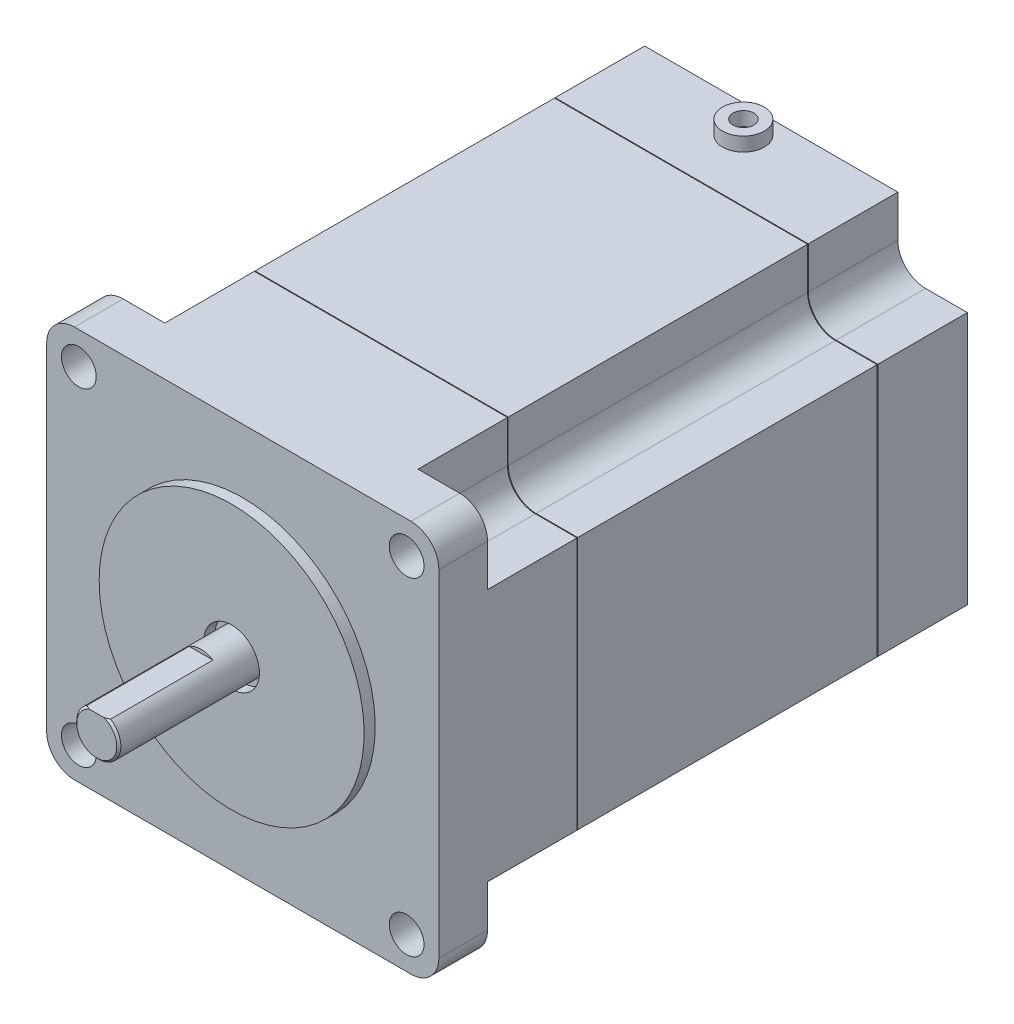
ISO-10303-21;
HEADER;
FILE_DESCRIPTION(('STEP AP214'),'2;1');
FILE_NAME('part.step','',(''),(''),'','','');
FILE_SCHEMA(('AUTOMOTIVE_DESIGN { 1 0 10303 214 1 1 1 1 }'));
ENDSEC;
DATA;
#1=APPLICATION_CONTEXT('core data for automotive mechanical design processes');
#2=APPLICATION_PROTOCOL_DEFINITION('international standard','automotive_design',2000,#1);
#3=PRODUCT_CONTEXT('',#1,'mechanical');
#4=PRODUCT('Part','Part','',(#3));
#5=PRODUCT_RELATED_PRODUCT_CATEGORY('part','',(#4));
#6=PRODUCT_DEFINITION_FORMATION('','',#4);
#7=PRODUCT_DEFINITION_CONTEXT('part definition',#1,'design');
#8=PRODUCT_DEFINITION('design','',#6,#7);
#9=PRODUCT_DEFINITION_SHAPE('','',#8);
#10=(LENGTH_UNIT() NAMED_UNIT(*) SI_UNIT(.MILLI.,.METRE.));
#11=(NAMED_UNIT(*) PLANE_ANGLE_UNIT() SI_UNIT($,.RADIAN.));
#12=(NAMED_UNIT(*) SI_UNIT($,.STERADIAN.) SOLID_ANGLE_UNIT());
#13=UNCERTAINTY_MEASURE_WITH_UNIT(LENGTH_MEASURE(1.E-05),#10,'distance_accuracy_value','');
#14=(GEOMETRIC_REPRESENTATION_CONTEXT(3) GLOBAL_UNCERTAINTY_ASSIGNED_CONTEXT((#13)) GLOBAL_UNIT_ASSIGNED_CONTEXT((#10,
#11,#12)) REPRESENTATION_CONTEXT('',''));
#15=CARTESIAN_POINT('',(0.,0.,0.));
#16=DIRECTION('',(0.,0.,1.));
#17=DIRECTION('',(1.,0.,0.));
#18=AXIS2_PLACEMENT_3D('',#15,#16,#17);
#19=CARTESIAN_POINT('',(-18.1999999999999,28.2,76.));
#20=DIRECTION('',(0.,-1.,0.));
#21=DIRECTION('',(1.,0.,0.));
#22=AXIS2_PLACEMENT_3D('',#19,#20,#21);
#23=PLANE('',#22);
#24=CARTESIAN_POINT('',(0.,28.2,4.));
#25=DIRECTION('',(0.,-1.,0.));
#26=DIRECTION('',(1.,0.,0.));
#27=AXIS2_PLACEMENT_3D('',#24,#25,#26);
#28=CIRCLE('',#27,1.5);
#29=CARTESIAN_POINT('',(1.50000000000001,28.2,4.));
#30=VERTEX_POINT('',#29);
#31=EDGE_CURVE('P0_E20',#30,#30,#28,.F.);
#32=ORIENTED_EDGE('',*,*,#31,.T.);
#33=EDGE_LOOP('',(#32));
#34=FACE_BOUND('',#33,.T.);
#35=ADVANCED_FACE('P0_F17',(#34),#23,.F.);
#36=CARTESIAN_POINT('',(0.,30.2,4.));
#37=DIRECTION('',(0.,-1.,0.));
#38=DIRECTION('',(1.,0.,0.));
#39=AXIS2_PLACEMENT_3D('',#36,#37,#38);
#40=CYLINDRICAL_SURFACE('',#39,1.5);
#41=CARTESIAN_POINT('',(0.,30.2,4.));
#42=DIRECTION('',(0.,-1.,0.));
#43=DIRECTION('',(1.,0.,0.));
#44=AXIS2_PLACEMENT_3D('',#41,#42,#43);
#45=CIRCLE('',#44,1.5);
#46=CARTESIAN_POINT('',(1.50000000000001,30.2,4.));
#47=VERTEX_POINT('',#46);
#48=EDGE_CURVE('P0_E344',#47,#47,#45,.T.);
#49=ORIENTED_EDGE('',*,*,#48,.F.);
#50=EDGE_LOOP('',(#49));
#51=FACE_BOUND('',#50,.T.);
#52=ORIENTED_EDGE('',*,*,#31,.F.);
#53=EDGE_LOOP('',(#52));
#54=FACE_BOUND('',#53,.T.);
#55=ADVANCED_FACE('P0_F352',(#51,#54),#40,.F.);
#56=CARTESIAN_POINT('',(0.,30.2,4.));
#57=DIRECTION('',(0.,1.,0.));
#58=DIRECTION('',(-1.,0.,0.));
#59=AXIS2_PLACEMENT_3D('',#56,#57,#58);
#60=PLANE('',#59);
#61=ORIENTED_EDGE('',*,*,#48,.T.);
#62=EDGE_LOOP('',(#61));
#63=FACE_BOUND('',#62,.T.);
#64=CARTESIAN_POINT('',(0.,30.2,4.));
#65=DIRECTION('',(0.,-1.,0.));
#66=DIRECTION('',(1.,0.,0.));
#67=AXIS2_PLACEMENT_3D('',#64,#65,#66);
#68=CIRCLE('',#67,3.);
#69=CARTESIAN_POINT('',(3.00000000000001,30.2,4.));
#70=VERTEX_POINT('',#69);
#71=EDGE_CURVE('P0_E291',#70,#70,#68,.T.);
#72=ORIENTED_EDGE('',*,*,#71,.F.);
#73=EDGE_LOOP('',(#72));
#74=FACE_BOUND('',#73,.T.);
#75=ADVANCED_FACE('P0_F354',(#63,#74),#60,.T.);
#76=CARTESIAN_POINT('',(0.,30.2,4.));
#77=DIRECTION('',(0.,-1.,0.));
#78=DIRECTION('',(1.,0.,0.));
#79=AXIS2_PLACEMENT_3D('',#76,#77,#78);
#80=CYLINDRICAL_SURFACE('',#79,3.);
#81=ORIENTED_EDGE('',*,*,#71,.T.);
#82=EDGE_LOOP('',(#81));
#83=FACE_BOUND('',#82,.T.);
#84=CARTESIAN_POINT('',(0.,28.2,4.));
#85=DIRECTION('',(0.,-1.,0.));
#86=DIRECTION('',(1.,0.,0.));
#87=AXIS2_PLACEMENT_3D('',#84,#85,#86);
#88=CIRCLE('',#87,3.);
#89=CARTESIAN_POINT('',(3.00000000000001,28.2,4.));
#90=VERTEX_POINT('',#89);
#91=EDGE_CURVE('P0_E236',#90,#90,#88,.F.);
#92=ORIENTED_EDGE('',*,*,#91,.T.);
#93=EDGE_LOOP('',(#92));
#94=FACE_BOUND('',#93,.T.);
#95=ADVANCED_FACE('P0_F361',(#83,#94),#80,.T.);
#96=CARTESIAN_POINT('',(18.2,18.2,0.));
#97=DIRECTION('',(0.,0.,1.));
#98=DIRECTION('',(1.,0.,0.));
#99=AXIS2_PLACEMENT_3D('',#96,#97,#98);
#100=PLANE('',#99);
#101=CARTESIAN_POINT('',(22.2,22.2,0.));
#102=DIRECTION('',(0.,0.,1.));
#103=DIRECTION('',(1.,0.,0.));
#104=AXIS2_PLACEMENT_3D('',#101,#102,#103);
#105=CIRCLE('',#104,4.);
#106=CARTESIAN_POINT('',(18.2,22.2,0.));
#107=VERTEX_POINT('',#106);
#108=CARTESIAN_POINT('',(22.2,18.2,0.));
#109=VERTEX_POINT('',#108);
#110=EDGE_CURVE('P0_E222',#107,#109,#105,.T.);
#111=ORIENTED_EDGE('',*,*,#110,.T.);
#112=DIRECTION('',(1.,0.,0.));
#113=VECTOR('',#112,1.);
#114=CARTESIAN_POINT('',(18.2,18.2,0.));
#115=LINE('',#114,#113);
#116=CARTESIAN_POINT('',(28.2,18.2,0.));
#117=VERTEX_POINT('',#116);
#118=EDGE_CURVE('P0_E218',#109,#117,#115,.T.);
#119=ORIENTED_EDGE('',*,*,#118,.T.);
#120=DIRECTION('',(0.,-1.,0.));
#121=VECTOR('',#120,1.);
#122=CARTESIAN_POINT('',(28.2,18.2,0.));
#123=LINE('',#122,#121);
#124=CARTESIAN_POINT('',(28.2,-18.2,0.));
#125=VERTEX_POINT('',#124);
#126=EDGE_CURVE('P0_E142',#117,#125,#123,.T.);
#127=ORIENTED_EDGE('',*,*,#126,.T.);
#128=DIRECTION('',(-1.,0.,0.));
#129=VECTOR('',#128,1.);
#130=CARTESIAN_POINT('',(28.2,-18.2,0.));
#131=LINE('',#130,#129);
#132=CARTESIAN_POINT('',(22.2,-18.2,0.));
#133=VERTEX_POINT('',#132);
#134=EDGE_CURVE('P0_E146',#125,#133,#131,.T.);
#135=ORIENTED_EDGE('',*,*,#134,.T.);
#136=CARTESIAN_POINT('',(22.2,-22.2,0.));
#137=DIRECTION('',(0.,0.,1.));
#138=DIRECTION('',(1.,0.,0.));
#139=AXIS2_PLACEMENT_3D('',#136,#137,#138);
#140=CIRCLE('',#139,4.);
#141=CARTESIAN_POINT('',(18.2,-22.2,0.));
#142=VERTEX_POINT('',#141);
#143=EDGE_CURVE('P0_E207',#133,#142,#140,.T.);
#144=ORIENTED_EDGE('',*,*,#143,.T.);
#145=DIRECTION('',(0.,-1.,0.));
#146=VECTOR('',#145,1.);
#147=CARTESIAN_POINT('',(18.2,-18.2,0.));
#148=LINE('',#147,#146);
#149=CARTESIAN_POINT('',(18.2,-28.2,0.));
#150=VERTEX_POINT('',#149);
#151=EDGE_CURVE('P0_E288',#142,#150,#148,.T.);
#152=ORIENTED_EDGE('',*,*,#151,.T.);
#153=DIRECTION('',(1.,0.,0.));
#154=VECTOR('',#153,1.);
#155=CARTESIAN_POINT('',(18.2,-28.2,0.));
#156=LINE('',#155,#154);
#157=CARTESIAN_POINT('',(-18.2,-28.1999999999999,0.));
#158=VERTEX_POINT('',#157);
#159=EDGE_CURVE('P0_E281',#150,#158,#156,.F.);
#160=ORIENTED_EDGE('',*,*,#159,.T.);
#161=DIRECTION('',(0.,1.,0.));
#162=VECTOR('',#161,1.);
#163=CARTESIAN_POINT('',(-18.2,-28.2,0.));
#164=LINE('',#163,#162);
#165=CARTESIAN_POINT('',(-18.2,-22.2,0.));
#166=VERTEX_POINT('',#165);
#167=EDGE_CURVE('P0_E105',#158,#166,#164,.T.);
#168=ORIENTED_EDGE('',*,*,#167,.T.);
#169=CARTESIAN_POINT('',(-22.2,-22.2,0.));
#170=DIRECTION('',(0.,0.,1.));
#171=DIRECTION('',(1.,0.,0.));
#172=AXIS2_PLACEMENT_3D('',#169,#170,#171);
#173=CIRCLE('',#172,4.);
#174=CARTESIAN_POINT('',(-22.2,-18.2,0.));
#175=VERTEX_POINT('',#174);
#176=EDGE_CURVE('P0_E97',#166,#175,#173,.T.);
#177=ORIENTED_EDGE('',*,*,#176,.T.);
#178=DIRECTION('',(-1.,0.,0.));
#179=VECTOR('',#178,1.);
#180=CARTESIAN_POINT('',(-18.2,-18.2,0.));
#181=LINE('',#180,#179);
#182=CARTESIAN_POINT('',(-28.2,-18.2,0.));
#183=VERTEX_POINT('',#182);
#184=EDGE_CURVE('P0_E266',#175,#183,#181,.T.);
#185=ORIENTED_EDGE('',*,*,#184,.T.);
#186=DIRECTION('',(0.,1.,0.));
#187=VECTOR('',#186,1.);
#188=CARTESIAN_POINT('',(-28.2,-18.2,0.));
#189=LINE('',#188,#187);
#190=CARTESIAN_POINT('',(-28.2,18.2,0.));
#191=VERTEX_POINT('',#190);
#192=EDGE_CURVE('P0_E261',#183,#191,#189,.T.);
#193=ORIENTED_EDGE('',*,*,#192,.T.);
#194=DIRECTION('',(1.,0.,0.));
#195=VECTOR('',#194,1.);
#196=CARTESIAN_POINT('',(-28.2,18.2,0.));
#197=LINE('',#196,#195);
#198=CARTESIAN_POINT('',(-22.1999999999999,18.2,0.));
#199=VERTEX_POINT('',#198);
#200=EDGE_CURVE('P0_E251',#191,#199,#197,.T.);
#201=ORIENTED_EDGE('',*,*,#200,.T.);
#202=CARTESIAN_POINT('',(-22.1999999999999,22.2,0.));
#203=DIRECTION('',(0.,0.,1.));
#204=DIRECTION('',(1.,0.,0.));
#205=AXIS2_PLACEMENT_3D('',#202,#203,#204);
#206=CIRCLE('',#205,4.);
#207=CARTESIAN_POINT('',(-18.2,22.2,0.));
#208=VERTEX_POINT('',#207);
#209=EDGE_CURVE('P0_E247',#199,#208,#206,.T.);
#210=ORIENTED_EDGE('',*,*,#209,.T.);
#211=DIRECTION('',(0.,1.,0.));
#212=VECTOR('',#211,1.);
#213=CARTESIAN_POINT('',(-18.2,18.2,0.));
#214=LINE('',#213,#212);
#215=CARTESIAN_POINT('',(-18.1999999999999,28.2,0.));
#216=VERTEX_POINT('',#215);
#217=EDGE_CURVE('P0_E243',#208,#216,#214,.T.);
#218=ORIENTED_EDGE('',*,*,#217,.T.);
#219=DIRECTION('',(1.,0.,0.));
#220=VECTOR('',#219,1.);
#221=CARTESIAN_POINT('',(-18.1999999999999,28.2,0.));
#222=LINE('',#221,#220);
#223=CARTESIAN_POINT('',(18.2,28.2,0.));
#224=VERTEX_POINT('',#223);
#225=EDGE_CURVE('P0_E237',#216,#224,#222,.T.);
#226=ORIENTED_EDGE('',*,*,#225,.T.);
#227=DIRECTION('',(0.,-1.,0.));
#228=VECTOR('',#227,1.);
#229=CARTESIAN_POINT('',(18.2,28.2,0.));
#230=LINE('',#229,#228);
#231=EDGE_CURVE('P0_E226',#224,#107,#230,.T.);
#232=ORIENTED_EDGE('',*,*,#231,.T.);
#233=EDGE_LOOP('',(#111,#119,#127,#135,#144,#152,#160,#168,#177,#185,#193,#201,#210,#218,#226,#232));
#234=FACE_BOUND('',#233,.T.);
#235=ADVANCED_FACE('P0_F424',(#234),#100,.F.);
#236=CARTESIAN_POINT('',(18.2,-18.2,76.));
#237=DIRECTION('',(-1.,0.,0.));
#238=DIRECTION('',(0.,-1.,0.));
#239=AXIS2_PLACEMENT_3D('',#236,#237,#238);
#240=PLANE('',#239);
#241=DIRECTION('',(0.,1.,0.));
#242=VECTOR('',#241,1.);
#243=CARTESIAN_POINT('',(18.2,28.2000000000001,12.8732));
#244=LINE('',#243,#242);
#245=CARTESIAN_POINT('',(18.2,-22.2,12.8732));
#246=VERTEX_POINT('',#245);
#247=CARTESIAN_POINT('',(18.2,-28.2,12.8732));
#248=VERTEX_POINT('',#247);
#249=EDGE_CURVE('P0_E199',#246,#248,#244,.F.);
#250=ORIENTED_EDGE('',*,*,#249,.T.);
#251=DIRECTION('',(0.,0.,1.));
#252=VECTOR('',#251,1.);
#253=CARTESIAN_POINT('',(18.2,-28.2,76.));
#254=LINE('',#253,#252);
#255=EDGE_CURVE('P0_E278',#248,#150,#254,.F.);
#256=ORIENTED_EDGE('',*,*,#255,.T.);
#257=ORIENTED_EDGE('',*,*,#151,.F.);
#258=DIRECTION('',(0.,0.,1.));
#259=VECTOR('',#258,1.);
#260=CARTESIAN_POINT('',(18.2,-22.2,76.));
#261=LINE('',#260,#259);
#262=EDGE_CURVE('P0_E204',#142,#246,#261,.T.);
#263=ORIENTED_EDGE('',*,*,#262,.T.);
#264=EDGE_LOOP('',(#250,#256,#257,#263));
#265=FACE_BOUND('',#264,.T.);
#266=ADVANCED_FACE('P0_F420',(#265),#240,.F.);
#267=CARTESIAN_POINT('',(18.2,-28.2,76.));
#268=DIRECTION('',(0.,1.,0.));
#269=DIRECTION('',(0.,0.,1.));
#270=AXIS2_PLACEMENT_3D('',#267,#268,#269);
#271=PLANE('',#270);
#272=DIRECTION('',(1.,0.,0.));
#273=VECTOR('',#272,1.);
#274=CARTESIAN_POINT('',(-28.2,-28.2,12.8732));
#275=LINE('',#274,#273);
#276=CARTESIAN_POINT('',(-18.2,-28.2,12.8732));
#277=VERTEX_POINT('',#276);
#278=EDGE_CURVE('P0_E196',#248,#277,#275,.F.);
#279=ORIENTED_EDGE('',*,*,#278,.T.);
#280=DIRECTION('',(0.,0.,1.));
#281=VECTOR('',#280,1.);
#282=CARTESIAN_POINT('',(-18.2,-28.1999999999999,76.));
#283=LINE('',#282,#281);
#284=EDGE_CURVE('P0_E269',#277,#158,#283,.F.);
#285=ORIENTED_EDGE('',*,*,#284,.T.);
#286=ORIENTED_EDGE('',*,*,#159,.F.);
#287=ORIENTED_EDGE('',*,*,#255,.F.);
#288=EDGE_LOOP('',(#279,#285,#286,#287));
#289=FACE_BOUND('',#288,.T.);
#290=ADVANCED_FACE('P0_F417',(#289),#271,.F.);
#291=CARTESIAN_POINT('',(-18.2,-28.2,76.));
#292=DIRECTION('',(1.,0.,0.));
#293=DIRECTION('',(0.,1.,0.));
#294=AXIS2_PLACEMENT_3D('',#291,#292,#293);
#295=PLANE('',#294);
#296=DIRECTION('',(0.,1.,0.));
#297=VECTOR('',#296,1.);
#298=CARTESIAN_POINT('',(-18.2,28.2000000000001,12.8732));
#299=LINE('',#298,#297);
#300=CARTESIAN_POINT('',(-18.2,-22.2,12.8732));
#301=VERTEX_POINT('',#300);
#302=EDGE_CURVE('P0_E193',#277,#301,#299,.T.);
#303=ORIENTED_EDGE('',*,*,#302,.T.);
#304=DIRECTION('',(0.,0.,1.));
#305=VECTOR('',#304,1.);
#306=CARTESIAN_POINT('',(-18.2,-22.2,76.));
#307=LINE('',#306,#305);
#308=EDGE_CURVE('P0_E267',#301,#166,#307,.F.);
#309=ORIENTED_EDGE('',*,*,#308,.T.);
#310=ORIENTED_EDGE('',*,*,#167,.F.);
#311=ORIENTED_EDGE('',*,*,#284,.F.);
#312=EDGE_LOOP('',(#303,#309,#310,#311));
#313=FACE_BOUND('',#312,.T.);
#314=ADVANCED_FACE('P0_F414',(#313),#295,.F.);
#315=CARTESIAN_POINT('',(-22.2,-22.2,76.));
#316=DIRECTION('',(0.,0.,1.));
#317=DIRECTION('',(1.,0.,0.));
#318=AXIS2_PLACEMENT_3D('',#315,#316,#317);
#319=CYLINDRICAL_SURFACE('',#318,4.);
#320=CARTESIAN_POINT('',(-22.2,-22.2,12.8732));
#321=DIRECTION('',(0.,0.,1.));
#322=DIRECTION('',(1.,0.,0.));
#323=AXIS2_PLACEMENT_3D('',#320,#321,#322);
#324=CIRCLE('',#323,4.);
#325=CARTESIAN_POINT('',(-22.2,-18.2,12.8732));
#326=VERTEX_POINT('',#325);
#327=EDGE_CURVE('P0_E190',#301,#326,#324,.T.);
#328=ORIENTED_EDGE('',*,*,#327,.T.);
#329=DIRECTION('',(0.,0.,1.));
#330=VECTOR('',#329,1.);
#331=CARTESIAN_POINT('',(-22.2,-18.2,76.));
#332=LINE('',#331,#330);
#333=EDGE_CURVE('P0_E264',#326,#175,#332,.F.);
#334=ORIENTED_EDGE('',*,*,#333,.T.);
#335=ORIENTED_EDGE('',*,*,#176,.F.);
#336=ORIENTED_EDGE('',*,*,#308,.F.);
#337=EDGE_LOOP('',(#328,#334,#335,#336));
#338=FACE_BOUND('',#337,.T.);
#339=ADVANCED_FACE('P0_F410',(#338),#319,.F.);
#340=CARTESIAN_POINT('',(-18.2,-18.2,76.));
#341=DIRECTION('',(0.,1.,0.));
#342=DIRECTION('',(-1.,0.,0.));
#343=AXIS2_PLACEMENT_3D('',#340,#341,#342);
#344=PLANE('',#343);
#345=DIRECTION('',(1.,0.,0.));
#346=VECTOR('',#345,1.);
#347=CARTESIAN_POINT('',(-28.2,-18.2,12.8732));
#348=LINE('',#347,#346);
#349=CARTESIAN_POINT('',(-28.2000000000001,-18.2,12.8732));
#350=VERTEX_POINT('',#349);
#351=EDGE_CURVE('P0_E187',#326,#350,#348,.F.);
#352=ORIENTED_EDGE('',*,*,#351,.T.);
#353=DIRECTION('',(0.,0.,1.));
#354=VECTOR('',#353,1.);
#355=CARTESIAN_POINT('',(-28.2,-18.2,76.));
#356=LINE('',#355,#354);
#357=EDGE_CURVE('P0_E258',#350,#183,#356,.F.);
#358=ORIENTED_EDGE('',*,*,#357,.T.);
#359=ORIENTED_EDGE('',*,*,#184,.F.);
#360=ORIENTED_EDGE('',*,*,#333,.F.);
#361=EDGE_LOOP('',(#352,#358,#359,#360));
#362=FACE_BOUND('',#361,.T.);
#363=ADVANCED_FACE('P0_F406',(#362),#344,.F.);
#364=CARTESIAN_POINT('',(-28.2,-18.2,76.));
#365=DIRECTION('',(1.,0.,0.));
#366=DIRECTION('',(0.,1.,0.));
#367=AXIS2_PLACEMENT_3D('',#364,#365,#366);
#368=PLANE('',#367);
#369=DIRECTION('',(0.,1.,0.));
#370=VECTOR('',#369,1.);
#371=CARTESIAN_POINT('',(-28.2000000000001,28.2000000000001,12.8732));
#372=LINE('',#371,#370);
#373=CARTESIAN_POINT('',(-28.2000000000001,18.2,12.8732));
#374=VERTEX_POINT('',#373);
#375=EDGE_CURVE('P0_E184',#350,#374,#372,.T.);
#376=ORIENTED_EDGE('',*,*,#375,.T.);
#377=DIRECTION('',(0.,0.,-1.));
#378=VECTOR('',#377,1.);
#379=CARTESIAN_POINT('',(-28.2000000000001,18.2,76.));
#380=LINE('',#379,#378);
#381=EDGE_CURVE('P0_E248',#374,#191,#380,.T.);
#382=ORIENTED_EDGE('',*,*,#381,.T.);
#383=ORIENTED_EDGE('',*,*,#192,.F.);
#384=ORIENTED_EDGE('',*,*,#357,.F.);
#385=EDGE_LOOP('',(#376,#382,#383,#384));
#386=FACE_BOUND('',#385,.T.);
#387=ADVANCED_FACE('P0_F402',(#386),#368,.F.);
#388=CARTESIAN_POINT('',(-28.2,18.2,76.));
#389=DIRECTION('',(0.,-1.,0.));
#390=DIRECTION('',(0.,0.,-1.));
#391=AXIS2_PLACEMENT_3D('',#388,#389,#390);
#392=PLANE('',#391);
#393=DIRECTION('',(1.,0.,0.));
#394=VECTOR('',#393,1.);
#395=CARTESIAN_POINT('',(-28.2,18.2,12.8732));
#396=LINE('',#395,#394);
#397=CARTESIAN_POINT('',(-22.1999999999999,18.2,12.8732));
#398=VERTEX_POINT('',#397);
#399=EDGE_CURVE('P0_E181',#374,#398,#396,.T.);
#400=ORIENTED_EDGE('',*,*,#399,.T.);
#401=DIRECTION('',(0.,0.,1.));
#402=VECTOR('',#401,1.);
#403=CARTESIAN_POINT('',(-22.1999999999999,18.2,76.));
#404=LINE('',#403,#402);
#405=EDGE_CURVE('P0_E244',#398,#199,#404,.F.);
#406=ORIENTED_EDGE('',*,*,#405,.T.);
#407=ORIENTED_EDGE('',*,*,#200,.F.);
#408=ORIENTED_EDGE('',*,*,#381,.F.);
#409=EDGE_LOOP('',(#400,#406,#407,#408));
#410=FACE_BOUND('',#409,.T.);
#411=ADVANCED_FACE('P0_F398',(#410),#392,.F.);
#412=CARTESIAN_POINT('',(-22.1999999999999,22.2,76.));
#413=DIRECTION('',(0.,0.,1.));
#414=DIRECTION('',(1.,0.,0.));
#415=AXIS2_PLACEMENT_3D('',#412,#413,#414);
#416=CYLINDRICAL_SURFACE('',#415,4.);
#417=CARTESIAN_POINT('',(-22.1999999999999,22.2,12.8732));
#418=DIRECTION('',(0.,0.,1.));
#419=DIRECTION('',(1.,0.,0.));
#420=AXIS2_PLACEMENT_3D('',#417,#418,#419);
#421=CIRCLE('',#420,4.);
#422=CARTESIAN_POINT('',(-18.2,22.2,12.8732));
#423=VERTEX_POINT('',#422);
#424=EDGE_CURVE('P0_E178',#398,#423,#421,.T.);
#425=ORIENTED_EDGE('',*,*,#424,.T.);
#426=DIRECTION('',(0.,0.,1.));
#427=VECTOR('',#426,1.);
#428=CARTESIAN_POINT('',(-18.2,22.2,76.));
#429=LINE('',#428,#427);
#430=EDGE_CURVE('P0_E240',#423,#208,#429,.F.);
#431=ORIENTED_EDGE('',*,*,#430,.T.);
#432=ORIENTED_EDGE('',*,*,#209,.F.);
#433=ORIENTED_EDGE('',*,*,#405,.F.);
#434=EDGE_LOOP('',(#425,#431,#432,#433));
#435=FACE_BOUND('',#434,.T.);
#436=ADVANCED_FACE('P0_F394',(#435),#416,.F.);
#437=CARTESIAN_POINT('',(-18.2,18.2,76.));
#438=DIRECTION('',(1.,0.,0.));
#439=DIRECTION('',(0.,1.,0.));
#440=AXIS2_PLACEMENT_3D('',#437,#438,#439);
#441=PLANE('',#440);
#442=DIRECTION('',(0.,1.,0.));
#443=VECTOR('',#442,1.);
#444=CARTESIAN_POINT('',(-18.1999999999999,28.2000000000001,12.8732));
#445=LINE('',#444,#443);
#446=CARTESIAN_POINT('',(-18.1999999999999,28.2,12.8732));
#447=VERTEX_POINT('',#446);
#448=EDGE_CURVE('P0_E175',#423,#447,#445,.T.);
#449=ORIENTED_EDGE('',*,*,#448,.T.);
#450=DIRECTION('',(0.,0.,1.));
#451=VECTOR('',#450,1.);
#452=CARTESIAN_POINT('',(-18.1999999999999,28.2,76.));
#453=LINE('',#452,#451);
#454=EDGE_CURVE('P0_E233',#447,#216,#453,.F.);
#455=ORIENTED_EDGE('',*,*,#454,.T.);
#456=ORIENTED_EDGE('',*,*,#217,.F.);
#457=ORIENTED_EDGE('',*,*,#430,.F.);
#458=EDGE_LOOP('',(#449,#455,#456,#457));
#459=FACE_BOUND('',#458,.T.);
#460=ADVANCED_FACE('P0_F390',(#459),#441,.F.);
#461=CARTESIAN_POINT('',(-18.1999999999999,28.2,76.));
#462=DIRECTION('',(0.,-1.,0.));
#463=DIRECTION('',(1.,0.,0.));
#464=AXIS2_PLACEMENT_3D('',#461,#462,#463);
#465=PLANE('',#464);
#466=ORIENTED_EDGE('',*,*,#91,.F.);
#467=EDGE_LOOP('',(#466));
#468=FACE_BOUND('',#467,.T.);
#469=DIRECTION('',(1.,0.,0.));
#470=VECTOR('',#469,1.);
#471=CARTESIAN_POINT('',(-28.2,28.2,12.8732));
#472=LINE('',#471,#470);
#473=CARTESIAN_POINT('',(18.2,28.2,12.8732));
#474=VERTEX_POINT('',#473);
#475=EDGE_CURVE('P0_E172',#447,#474,#472,.T.);
#476=ORIENTED_EDGE('',*,*,#475,.T.);
#477=DIRECTION('',(0.,0.,1.));
#478=VECTOR('',#477,1.);
#479=CARTESIAN_POINT('',(18.2,28.2,76.));
#480=LINE('',#479,#478);
#481=EDGE_CURVE('P0_E223',#474,#224,#480,.F.);
#482=ORIENTED_EDGE('',*,*,#481,.T.);
#483=ORIENTED_EDGE('',*,*,#225,.F.);
#484=ORIENTED_EDGE('',*,*,#454,.F.);
#485=EDGE_LOOP('',(#476,#482,#483,#484));
#486=FACE_BOUND('',#485,.T.);
#487=ADVANCED_FACE('P0_F386',(#468,#486),#465,.F.);
#488=CARTESIAN_POINT('',(18.2,28.2,76.));
#489=DIRECTION('',(-1.,0.,0.));
#490=DIRECTION('',(0.,-1.,0.));
#491=AXIS2_PLACEMENT_3D('',#488,#489,#490);
#492=PLANE('',#491);
#493=DIRECTION('',(0.,1.,0.));
#494=VECTOR('',#493,1.);
#495=CARTESIAN_POINT('',(18.2,28.2000000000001,12.8732));
#496=LINE('',#495,#494);
#497=CARTESIAN_POINT('',(18.2,22.2,12.8732));
#498=VERTEX_POINT('',#497);
#499=EDGE_CURVE('P0_E162',#474,#498,#496,.F.);
#500=ORIENTED_EDGE('',*,*,#499,.T.);
#501=DIRECTION('',(0.,0.,1.));
#502=VECTOR('',#501,1.);
#503=CARTESIAN_POINT('',(18.2,22.2,76.));
#504=LINE('',#503,#502);
#505=EDGE_CURVE('P0_E219',#498,#107,#504,.F.);
#506=ORIENTED_EDGE('',*,*,#505,.T.);
#507=ORIENTED_EDGE('',*,*,#231,.F.);
#508=ORIENTED_EDGE('',*,*,#481,.F.);
#509=EDGE_LOOP('',(#500,#506,#507,#508));
#510=FACE_BOUND('',#509,.T.);
#511=ADVANCED_FACE('P0_F382',(#510),#492,.F.);
#512=CARTESIAN_POINT('',(22.2,22.2,76.));
#513=DIRECTION('',(0.,0.,1.));
#514=DIRECTION('',(1.,0.,0.));
#515=AXIS2_PLACEMENT_3D('',#512,#513,#514);
#516=CYLINDRICAL_SURFACE('',#515,4.);
#517=CARTESIAN_POINT('',(22.2,22.2,12.8732));
#518=DIRECTION('',(0.,0.,1.));
#519=DIRECTION('',(1.,0.,0.));
#520=AXIS2_PLACEMENT_3D('',#517,#518,#519);
#521=CIRCLE('',#520,4.);
#522=CARTESIAN_POINT('',(22.2,18.2,12.8732));
#523=VERTEX_POINT('',#522);
#524=EDGE_CURVE('P0_E160',#498,#523,#521,.T.);
#525=ORIENTED_EDGE('',*,*,#524,.T.);
#526=DIRECTION('',(0.,0.,1.));
#527=VECTOR('',#526,1.);
#528=CARTESIAN_POINT('',(22.2,18.2,76.));
#529=LINE('',#528,#527);
#530=EDGE_CURVE('P0_E159',#523,#109,#529,.F.);
#531=ORIENTED_EDGE('',*,*,#530,.T.);
#532=ORIENTED_EDGE('',*,*,#110,.F.);
#533=ORIENTED_EDGE('',*,*,#505,.F.);
#534=EDGE_LOOP('',(#525,#531,#532,#533));
#535=FACE_BOUND('',#534,.T.);
#536=ADVANCED_FACE('P0_F379',(#535),#516,.F.);
#537=CARTESIAN_POINT('',(18.2,18.2,76.));
#538=DIRECTION('',(0.,-1.,0.));
#539=DIRECTION('',(1.,0.,0.));
#540=AXIS2_PLACEMENT_3D('',#537,#538,#539);
#541=PLANE('',#540);
#542=DIRECTION('',(1.,0.,0.));
#543=VECTOR('',#542,1.);
#544=CARTESIAN_POINT('',(-28.2,18.2,12.8732));
#545=LINE('',#544,#543);
#546=CARTESIAN_POINT('',(28.2000000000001,18.2,12.8732));
#547=VERTEX_POINT('',#546);
#548=EDGE_CURVE('P0_E153',#523,#547,#545,.T.);
#549=ORIENTED_EDGE('',*,*,#548,.T.);
#550=DIRECTION('',(0.,0.,1.));
#551=VECTOR('',#550,1.);
#552=CARTESIAN_POINT('',(28.2,18.2,76.));
#553=LINE('',#552,#551);
#554=EDGE_CURVE('P0_E136',#547,#117,#553,.F.);
#555=ORIENTED_EDGE('',*,*,#554,.T.);
#556=ORIENTED_EDGE('',*,*,#118,.F.);
#557=ORIENTED_EDGE('',*,*,#530,.F.);
#558=EDGE_LOOP('',(#549,#555,#556,#557));
#559=FACE_BOUND('',#558,.T.);
#560=ADVANCED_FACE('P0_F157',(#559),#541,.F.);
#561=CARTESIAN_POINT('',(28.2,18.2,76.));
#562=DIRECTION('',(-1.,0.,0.));
#563=DIRECTION('',(0.,-1.,0.));
#564=AXIS2_PLACEMENT_3D('',#561,#562,#563);
#565=PLANE('',#564);
#566=DIRECTION('',(0.,1.,0.));
#567=VECTOR('',#566,1.);
#568=CARTESIAN_POINT('',(28.2000000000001,28.2000000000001,12.8732));
#569=LINE('',#568,#567);
#570=CARTESIAN_POINT('',(28.2000000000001,-18.2,12.8732));
#571=VERTEX_POINT('',#570);
#572=EDGE_CURVE('P0_E140',#547,#571,#569,.F.);
#573=ORIENTED_EDGE('',*,*,#572,.T.);
#574=DIRECTION('',(0.,0.,1.));
#575=VECTOR('',#574,1.);
#576=CARTESIAN_POINT('',(28.2,-18.2,76.));
#577=LINE('',#576,#575);
#578=EDGE_CURVE('P0_E209',#571,#125,#577,.F.);
#579=ORIENTED_EDGE('',*,*,#578,.T.);
#580=ORIENTED_EDGE('',*,*,#126,.F.);
#581=ORIENTED_EDGE('',*,*,#554,.F.);
#582=EDGE_LOOP('',(#573,#579,#580,#581));
#583=FACE_BOUND('',#582,.T.);
#584=ADVANCED_FACE('P0_F138',(#583),#565,.F.);
#585=CARTESIAN_POINT('',(28.2,-18.2,76.));
#586=DIRECTION('',(0.,1.,0.));
#587=DIRECTION('',(-1.,0.,0.));
#588=AXIS2_PLACEMENT_3D('',#585,#586,#587);
#589=PLANE('',#588);
#590=DIRECTION('',(1.,0.,0.));
#591=VECTOR('',#590,1.);
#592=CARTESIAN_POINT('',(-28.2,-18.2,12.8732));
#593=LINE('',#592,#591);
#594=CARTESIAN_POINT('',(22.2,-18.2,12.8732));
#595=VERTEX_POINT('',#594);
#596=EDGE_CURVE('P0_E26',#571,#595,#593,.F.);
#597=ORIENTED_EDGE('',*,*,#596,.T.);
#598=DIRECTION('',(0.,0.,1.));
#599=VECTOR('',#598,1.);
#600=CARTESIAN_POINT('',(22.2,-18.2,76.));
#601=LINE('',#600,#599);
#602=EDGE_CURVE('P0_E34',#595,#133,#601,.F.);
#603=ORIENTED_EDGE('',*,*,#602,.T.);
#604=ORIENTED_EDGE('',*,*,#134,.F.);
#605=ORIENTED_EDGE('',*,*,#578,.F.);
#606=EDGE_LOOP('',(#597,#603,#604,#605));
#607=FACE_BOUND('',#606,.T.);
#608=ADVANCED_FACE('P0_F369',(#607),#589,.F.);
#609=CARTESIAN_POINT('',(22.2,-22.2,76.));
#610=DIRECTION('',(0.,0.,1.));
#611=DIRECTION('',(1.,0.,0.));
#612=AXIS2_PLACEMENT_3D('',#609,#610,#611);
#613=CYLINDRICAL_SURFACE('',#612,4.);
#614=CARTESIAN_POINT('',(22.2,-22.2,12.8732));
#615=DIRECTION('',(0.,0.,1.));
#616=DIRECTION('',(1.,0.,0.));
#617=AXIS2_PLACEMENT_3D('',#614,#615,#616);
#618=CIRCLE('',#617,4.);
#619=EDGE_CURVE('P0_E11',#595,#246,#618,.T.);
#620=ORIENTED_EDGE('',*,*,#619,.T.);
#621=ORIENTED_EDGE('',*,*,#262,.F.);
#622=ORIENTED_EDGE('',*,*,#143,.F.);
#623=ORIENTED_EDGE('',*,*,#602,.F.);
#624=EDGE_LOOP('',(#620,#621,#622,#623));
#625=FACE_BOUND('',#624,.T.);
#626=ADVANCED_FACE('P0_F364',(#625),#613,.F.);
#627=CARTESIAN_POINT('',(-28.2,28.2000000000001,12.8732));
#628=DIRECTION('',(0.,0.,-1.));
#629=DIRECTION('',(0.,1.,0.));
#630=AXIS2_PLACEMENT_3D('',#627,#628,#629);
#631=PLANE('',#630);
#632=ORIENTED_EDGE('',*,*,#596,.F.);
#633=ORIENTED_EDGE('',*,*,#572,.F.);
#634=ORIENTED_EDGE('',*,*,#548,.F.);
#635=ORIENTED_EDGE('',*,*,#524,.F.);
#636=ORIENTED_EDGE('',*,*,#499,.F.);
#637=ORIENTED_EDGE('',*,*,#475,.F.);
#638=ORIENTED_EDGE('',*,*,#448,.F.);
#639=ORIENTED_EDGE('',*,*,#424,.F.);
#640=ORIENTED_EDGE('',*,*,#399,.F.);
#641=ORIENTED_EDGE('',*,*,#375,.F.);
#642=ORIENTED_EDGE('',*,*,#351,.F.);
#643=ORIENTED_EDGE('',*,*,#327,.F.);
#644=ORIENTED_EDGE('',*,*,#302,.F.);
#645=ORIENTED_EDGE('',*,*,#278,.F.);
#646=ORIENTED_EDGE('',*,*,#249,.F.);
#647=ORIENTED_EDGE('',*,*,#619,.F.);
#648=EDGE_LOOP('',(#632,#633,#634,#635,#636,#637,#638,#639,#640,#641,#642,#643,#644,#645,#646,#647));
#649=FACE_BOUND('',#648,.T.);
#650=ADVANCED_FACE('P0_F151',(#649),#631,.F.);
#651=CLOSED_SHELL('',(#35,#55,#75,#95,#235,#266,#290,#314,#339,#363,#387,#411,#436,#460,#487,
#511,#536,#560,#584,#608,#626,#650));
#652=MANIFOLD_SOLID_BREP('P0_B1',#651);
#653=CARTESIAN_POINT('',(0.,0.,97.));
#654=DIRECTION('',(0.,0.,1.));
#655=DIRECTION('',(1.,0.,0.));
#656=AXIS2_PLACEMENT_3D('',#653,#654,#655);
#657=PLANE('',#656);
#658=CARTESIAN_POINT('',(0.,0.,96.9999999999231));
#659=DIRECTION('',(0.,0.,-1.));
#660=DIRECTION('',(0.,1.,0.));
#661=AXIS2_PLACEMENT_3D('',#658,#659,#660);
#662=CIRCLE('',#661,2.87500000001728);
#663=CARTESIAN_POINT('',(1.05356537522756,2.675,96.9999999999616));
#664=VERTEX_POINT('',#663);
#665=CARTESIAN_POINT('',(-1.0535653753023,2.675,96.9999999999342));
#666=VERTEX_POINT('',#665);
#667=EDGE_CURVE('P1_E199',#664,#666,#662,.T.);
#668=ORIENTED_EDGE('',*,*,#667,.F.);
#669=DIRECTION('',(1.,0.,0.));
#670=VECTOR('',#669,1.);
#671=CARTESIAN_POINT('',(-1.71026313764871,2.675,97.));
#672=LINE('',#671,#670);
#673=EDGE_CURVE('P1_E204',#664,#666,#672,.F.);
#674=ORIENTED_EDGE('',*,*,#673,.T.);
#675=EDGE_LOOP('',(#668,#674));
#676=FACE_BOUND('',#675,.T.);
#677=ADVANCED_FACE('P1_F17',(#676),#657,.T.);
#678=CARTESIAN_POINT('',(0.,0.,82.));
#679=DIRECTION('',(0.,0.,1.));
#680=DIRECTION('',(1.,0.,0.));
#681=AXIS2_PLACEMENT_3D('',#678,#679,#680);
#682=PLANE('',#681);
#683=CARTESIAN_POINT('',(0.,0.,82.));
#684=DIRECTION('',(0.,0.,-1.));
#685=DIRECTION('',(-1.,0.,0.));
#686=AXIS2_PLACEMENT_3D('',#683,#684,#685);
#687=CIRCLE('',#686,3.175);
#688=CARTESIAN_POINT('',(-1.71026313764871,2.675,82.));
#689=VERTEX_POINT('',#688);
#690=CARTESIAN_POINT('',(1.71026313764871,2.675,82.));
#691=VERTEX_POINT('',#690);
#692=EDGE_CURVE('P1_E227',#689,#691,#687,.T.);
#693=ORIENTED_EDGE('',*,*,#692,.F.);
#694=DIRECTION('',(1.,0.,0.));
#695=VECTOR('',#694,1.);
#696=CARTESIAN_POINT('',(-1.71026313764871,2.675,82.));
#697=LINE('',#696,#695);
#698=EDGE_CURVE('P1_E217',#689,#691,#697,.T.);
#699=ORIENTED_EDGE('',*,*,#698,.T.);
#700=EDGE_LOOP('',(#693,#699));
#701=FACE_BOUND('',#700,.T.);
#702=ADVANCED_FACE('P1_F661',(#701),#682,.T.);
#703=CARTESIAN_POINT('',(-1.71026313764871,2.675,82.));
#704=DIRECTION('',(0.,-1.,0.));
#705=DIRECTION('',(0.,0.,-1.));
#706=AXIS2_PLACEMENT_3D('',#703,#704,#705);
#707=PLANE('',#706);
#708=ORIENTED_EDGE('',*,*,#673,.F.);
#709=CARTESIAN_POINT('',(1.71026313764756,2.675,96.6999999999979));
#710=CARTESIAN_POINT('',(1.65722340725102,2.675,96.7285655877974));
#711=CARTESIAN_POINT('',(1.6037875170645,2.675,96.7564112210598));
#712=CARTESIAN_POINT('',(1.49613975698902,2.675,96.8103817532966));
#713=CARTESIAN_POINT('',(1.44192895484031,2.675,96.8365087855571));
#714=CARTESIAN_POINT('',(1.33260256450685,2.675,96.886839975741));
#715=CARTESIAN_POINT('',(1.27748679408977,2.675,96.9110437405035));
#716=CARTESIAN_POINT('',(1.16626219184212,2.675,96.9572550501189));
#717=CARTESIAN_POINT('',(1.11015218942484,2.675,96.9792597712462));
#718=CARTESIAN_POINT('',(1.05356537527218,2.675,96.9999999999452));
#719=B_SPLINE_CURVE_WITH_KNOTS('',3,(#709,#710,#711,#712,#713,#714,#715,#716,#717,#718),
.UNSPECIFIED.,.F.,.F.,(4,2,2,2,4),(0.,0.180733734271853,0.361238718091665,0.541780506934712,
0.722551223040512),.UNSPECIFIED.);
#720=CARTESIAN_POINT('',(1.71026313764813,2.675,96.699999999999));
#721=VERTEX_POINT('',#720);
#722=EDGE_CURVE('P1_E20',#721,#664,#719,.T.);
#723=ORIENTED_EDGE('',*,*,#722,.F.);
#724=DIRECTION('',(0.,0.,-1.));
#725=VECTOR('',#724,1.);
#726=CARTESIAN_POINT('',(1.71026313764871,2.675,97.));
#727=LINE('',#726,#725);
#728=EDGE_CURVE('P1_E224',#691,#721,#727,.F.);
#729=ORIENTED_EDGE('',*,*,#728,.F.);
#730=ORIENTED_EDGE('',*,*,#698,.F.);
#731=DIRECTION('',(0.,0.,-1.));
#732=VECTOR('',#731,1.);
#733=CARTESIAN_POINT('',(-1.71026313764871,2.675,97.));
#734=LINE('',#733,#732);
#735=CARTESIAN_POINT('',(-1.71026313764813,2.675,96.699999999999));
#736=VERTEX_POINT('',#735);
#737=EDGE_CURVE('P1_E205',#736,#689,#734,.T.);
#738=ORIENTED_EDGE('',*,*,#737,.F.);
#739=CARTESIAN_POINT('',(-1.05356537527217,2.675,96.9999999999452));
#740=CARTESIAN_POINT('',(-1.11015218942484,2.675,96.9792597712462));
#741=CARTESIAN_POINT('',(-1.16626219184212,2.675,96.9572550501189));
#742=CARTESIAN_POINT('',(-1.27748679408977,2.675,96.9110437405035));
#743=CARTESIAN_POINT('',(-1.33260256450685,2.675,96.886839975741));
#744=CARTESIAN_POINT('',(-1.4419289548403,2.675,96.8365087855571));
#745=CARTESIAN_POINT('',(-1.49613975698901,2.675,96.8103817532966));
#746=CARTESIAN_POINT('',(-1.6037875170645,2.675,96.7564112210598));
#747=CARTESIAN_POINT('',(-1.65722340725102,2.675,96.7285655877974));
#748=CARTESIAN_POINT('',(-1.71026313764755,2.675,96.6999999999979));
#749=B_SPLINE_CURVE_WITH_KNOTS('',3,(#739,#740,#741,#742,#743,#744,#745,#746,#747,#748),
.UNSPECIFIED.,.F.,.F.,(4,2,2,2,4),(0.,0.18077071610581,0.36131250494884,0.541817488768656,
0.722551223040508),.UNSPECIFIED.);
#750=EDGE_CURVE('P1_E206',#666,#736,#749,.T.);
#751=ORIENTED_EDGE('',*,*,#750,.F.);
#752=EDGE_LOOP('',(#708,#723,#729,#730,#738,#751));
#753=FACE_BOUND('',#752,.T.);
#754=ADVANCED_FACE('P1_F210',(#753),#707,.F.);
#755=CARTESIAN_POINT('',(0.,0.,96.7000000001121));
#756=DIRECTION('',(0.,0.,-1.));
#757=DIRECTION('',(0.,1.,0.));
#758=AXIS2_PLACEMENT_3D('',#755,#756,#757);
#759=CONICAL_SURFACE('',#758,3.17499999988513,0.785398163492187);
#760=ORIENTED_EDGE('',*,*,#667,.T.);
#761=ORIENTED_EDGE('',*,*,#750,.T.);
#762=CARTESIAN_POINT('',(0.,0.,96.7));
#763=DIRECTION('',(0.,0.,-1.));
#764=DIRECTION('',(-1.,0.,0.));
#765=AXIS2_PLACEMENT_3D('',#762,#763,#764);
#766=CIRCLE('',#765,3.175);
#767=EDGE_CURVE('P1_E216',#721,#736,#766,.T.);
#768=ORIENTED_EDGE('',*,*,#767,.F.);
#769=ORIENTED_EDGE('',*,*,#722,.T.);
#770=EDGE_LOOP('',(#760,#761,#768,#769));
#771=FACE_BOUND('',#770,.T.);
#772=ADVANCED_FACE('P1_F215',(#771),#759,.T.);
#773=CARTESIAN_POINT('',(0.,0.,97.));
#774=DIRECTION('',(0.,0.,-1.));
#775=DIRECTION('',(-1.,0.,0.));
#776=AXIS2_PLACEMENT_3D('',#773,#774,#775);
#777=CYLINDRICAL_SURFACE('',#776,3.175);
#778=ORIENTED_EDGE('',*,*,#728,.T.);
#779=ORIENTED_EDGE('',*,*,#767,.T.);
#780=ORIENTED_EDGE('',*,*,#737,.T.);
#781=ORIENTED_EDGE('',*,*,#692,.T.);
#782=EDGE_LOOP('',(#778,#779,#780,#781));
#783=FACE_BOUND('',#782,.T.);
#784=CARTESIAN_POINT('',(0.,0.,76.));
#785=DIRECTION('',(0.,0.,-1.));
#786=DIRECTION('',(-1.,0.,0.));
#787=AXIS2_PLACEMENT_3D('',#784,#785,#786);
#788=CIRCLE('',#787,3.175);
#789=CARTESIAN_POINT('',(-3.175,0.,76.));
#790=VERTEX_POINT('',#789);
#791=EDGE_CURVE('P1_E319',#790,#790,#788,.T.);
#792=ORIENTED_EDGE('',*,*,#791,.F.);
#793=EDGE_LOOP('',(#792));
#794=FACE_BOUND('',#793,.T.);
#795=ADVANCED_FACE('P1_F329',(#783,#794),#777,.T.);
#796=CARTESIAN_POINT('',(18.2,18.2,76.));
#797=DIRECTION('',(0.,0.,1.));
#798=DIRECTION('',(1.,0.,0.));
#799=AXIS2_PLACEMENT_3D('',#796,#797,#798);
#800=PLANE('',#799);
#801=ORIENTED_EDGE('',*,*,#791,.T.);
#802=EDGE_LOOP('',(#801));
#803=FACE_BOUND('',#802,.T.);
#804=CARTESIAN_POINT('',(0.,0.,76.));
#805=DIRECTION('',(0.,0.,1.));
#806=DIRECTION('',(1.,0.,0.));
#807=AXIS2_PLACEMENT_3D('',#804,#805,#806);
#808=CIRCLE('',#807,4.);
#809=CARTESIAN_POINT('',(4.,0.,76.));
#810=VERTEX_POINT('',#809);
#811=EDGE_CURVE('P1_E316',#810,#810,#808,.T.);
#812=ORIENTED_EDGE('',*,*,#811,.T.);
#813=EDGE_LOOP('',(#812));
#814=FACE_BOUND('',#813,.T.);
#815=ADVANCED_FACE('P1_F333',(#803,#814),#800,.T.);
#816=CARTESIAN_POINT('',(0.,0.,64.6862915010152));
#817=DIRECTION('',(0.,0.,1.));
#818=DIRECTION('',(1.,0.,0.));
#819=AXIS2_PLACEMENT_3D('',#816,#817,#818);
#820=CYLINDRICAL_SURFACE('',#819,4.);
#821=CARTESIAN_POINT('',(0.,0.,77.6));
#822=DIRECTION('',(0.,0.,1.));
#823=DIRECTION('',(1.,0.,0.));
#824=AXIS2_PLACEMENT_3D('',#821,#822,#823);
#825=CIRCLE('',#824,4.);
#826=CARTESIAN_POINT('',(4.,0.,77.6));
#827=VERTEX_POINT('',#826);
#828=EDGE_CURVE('P1_E313',#827,#827,#825,.F.);
#829=ORIENTED_EDGE('',*,*,#828,.F.);
#830=EDGE_LOOP('',(#829));
#831=FACE_BOUND('',#830,.T.);
#832=ORIENTED_EDGE('',*,*,#811,.F.);
#833=EDGE_LOOP('',(#832));
#834=FACE_BOUND('',#833,.T.);
#835=ADVANCED_FACE('P1_F337',(#831,#834),#820,.F.);
#836=CARTESIAN_POINT('',(0.,0.,77.6));
#837=DIRECTION('',(0.,0.,1.));
#838=DIRECTION('',(1.,0.,0.));
#839=AXIS2_PLACEMENT_3D('',#836,#837,#838);
#840=PLANE('',#839);
#841=CARTESIAN_POINT('',(0.,0.,77.6));
#842=DIRECTION('',(0.,0.,-1.));
#843=DIRECTION('',(-1.,0.,0.));
#844=AXIS2_PLACEMENT_3D('',#841,#842,#843);
#845=CIRCLE('',#844,19.05);
#846=CARTESIAN_POINT('',(-19.05,0.,77.6));
#847=VERTEX_POINT('',#846);
#848=EDGE_CURVE('P1_E310',#847,#847,#845,.T.);
#849=ORIENTED_EDGE('',*,*,#848,.F.);
#850=EDGE_LOOP('',(#849));
#851=FACE_BOUND('',#850,.T.);
#852=ORIENTED_EDGE('',*,*,#828,.T.);
#853=EDGE_LOOP('',(#852));
#854=FACE_BOUND('',#853,.T.);
#855=ADVANCED_FACE('P1_F341',(#851,#854),#840,.T.);
#856=CARTESIAN_POINT('',(-23.57,-23.57,0.));
#857=DIRECTION('',(0.,0.,1.));
#858=DIRECTION('',(1.,0.,0.));
#859=AXIS2_PLACEMENT_3D('',#856,#857,#858);
#860=CYLINDRICAL_SURFACE('',#859,2.5);
#861=CARTESIAN_POINT('',(-23.57,-23.57,76.));
#862=DIRECTION('',(0.,0.,1.));
#863=DIRECTION('',(1.,0.,0.));
#864=AXIS2_PLACEMENT_3D('',#861,#862,#863);
#865=CIRCLE('',#864,2.5);
#866=CARTESIAN_POINT('',(-21.07,-23.57,76.));
#867=VERTEX_POINT('',#866);
#868=EDGE_CURVE('P1_E287',#867,#867,#865,.F.);
#869=ORIENTED_EDGE('',*,*,#868,.F.);
#870=EDGE_LOOP('',(#869));
#871=FACE_BOUND('',#870,.T.);
#872=CARTESIAN_POINT('',(-23.57,-23.57,69.));
#873=DIRECTION('',(0.,0.,1.));
#874=DIRECTION('',(1.,0.,0.));
#875=AXIS2_PLACEMENT_3D('',#872,#873,#874);
#876=CIRCLE('',#875,2.5);
#877=CARTESIAN_POINT('',(-21.07,-23.57,69.));
#878=VERTEX_POINT('',#877);
#879=EDGE_CURVE('P1_E292',#878,#878,#876,.F.);
#880=ORIENTED_EDGE('',*,*,#879,.T.);
#881=EDGE_LOOP('',(#880));
#882=FACE_BOUND('',#881,.T.);
#883=ADVANCED_FACE('P1_F345',(#871,#882),#860,.F.);
#884=CARTESIAN_POINT('',(23.57,-23.57,0.));
#885=DIRECTION('',(0.,0.,1.));
#886=DIRECTION('',(1.,0.,0.));
#887=AXIS2_PLACEMENT_3D('',#884,#885,#886);
#888=CYLINDRICAL_SURFACE('',#887,2.5);
#889=CARTESIAN_POINT('',(23.57,-23.57,76.));
#890=DIRECTION('',(0.,0.,1.));
#891=DIRECTION('',(1.,0.,0.));
#892=AXIS2_PLACEMENT_3D('',#889,#890,#891);
#893=CIRCLE('',#892,2.5);
#894=CARTESIAN_POINT('',(26.07,-23.57,76.));
#895=VERTEX_POINT('',#894);
#896=EDGE_CURVE('P1_E284',#895,#895,#893,.F.);
#897=ORIENTED_EDGE('',*,*,#896,.F.);
#898=EDGE_LOOP('',(#897));
#899=FACE_BOUND('',#898,.T.);
#900=CARTESIAN_POINT('',(23.57,-23.57,69.));
#901=DIRECTION('',(0.,0.,1.));
#902=DIRECTION('',(1.,0.,0.));
#903=AXIS2_PLACEMENT_3D('',#900,#901,#902);
#904=CIRCLE('',#903,2.5);
#905=CARTESIAN_POINT('',(26.07,-23.57,69.));
#906=VERTEX_POINT('',#905);
#907=EDGE_CURVE('P1_E297',#906,#906,#904,.F.);
#908=ORIENTED_EDGE('',*,*,#907,.T.);
#909=EDGE_LOOP('',(#908));
#910=FACE_BOUND('',#909,.T.);
#911=ADVANCED_FACE('P1_F349',(#899,#910),#888,.F.);
#912=CARTESIAN_POINT('',(23.57,23.57,0.));
#913=DIRECTION('',(0.,0.,1.));
#914=DIRECTION('',(1.,0.,0.));
#915=AXIS2_PLACEMENT_3D('',#912,#913,#914);
#916=CYLINDRICAL_SURFACE('',#915,2.5);
#917=CARTESIAN_POINT('',(23.57,23.57,76.));
#918=DIRECTION('',(0.,0.,1.));
#919=DIRECTION('',(1.,0.,0.));
#920=AXIS2_PLACEMENT_3D('',#917,#918,#919);
#921=CIRCLE('',#920,2.5);
#922=CARTESIAN_POINT('',(26.07,23.57,76.));
#923=VERTEX_POINT('',#922);
#924=EDGE_CURVE('P1_E281',#923,#923,#921,.F.);
#925=ORIENTED_EDGE('',*,*,#924,.F.);
#926=EDGE_LOOP('',(#925));
#927=FACE_BOUND('',#926,.T.);
#928=CARTESIAN_POINT('',(23.57,23.57,69.));
#929=DIRECTION('',(0.,0.,1.));
#930=DIRECTION('',(1.,0.,0.));
#931=AXIS2_PLACEMENT_3D('',#928,#929,#930);
#932=CIRCLE('',#931,2.5);
#933=CARTESIAN_POINT('',(26.07,23.57,69.));
#934=VERTEX_POINT('',#933);
#935=EDGE_CURVE('P1_E307',#934,#934,#932,.F.);
#936=ORIENTED_EDGE('',*,*,#935,.T.);
#937=EDGE_LOOP('',(#936));
#938=FACE_BOUND('',#937,.T.);
#939=ADVANCED_FACE('P1_F353',(#927,#938),#916,.F.);
#940=CARTESIAN_POINT('',(-23.57,23.57,0.));
#941=DIRECTION('',(0.,0.,1.));
#942=DIRECTION('',(1.,0.,0.));
#943=AXIS2_PLACEMENT_3D('',#940,#941,#942);
#944=CYLINDRICAL_SURFACE('',#943,2.5);
#945=CARTESIAN_POINT('',(-23.57,23.57,76.));
#946=DIRECTION('',(0.,0.,1.));
#947=DIRECTION('',(1.,0.,0.));
#948=AXIS2_PLACEMENT_3D('',#945,#946,#947);
#949=CIRCLE('',#948,2.5);
#950=CARTESIAN_POINT('',(-21.07,23.57,76.));
#951=VERTEX_POINT('',#950);
#952=EDGE_CURVE('P1_E278',#951,#951,#949,.F.);
#953=ORIENTED_EDGE('',*,*,#952,.F.);
#954=EDGE_LOOP('',(#953));
#955=FACE_BOUND('',#954,.T.);
#956=CARTESIAN_POINT('',(-23.57,23.57,69.));
#957=DIRECTION('',(0.,0.,1.));
#958=DIRECTION('',(1.,0.,0.));
#959=AXIS2_PLACEMENT_3D('',#956,#957,#958);
#960=CIRCLE('',#959,2.5);
#961=CARTESIAN_POINT('',(-21.07,23.57,69.));
#962=VERTEX_POINT('',#961);
#963=EDGE_CURVE('P1_E302',#962,#962,#960,.F.);
#964=ORIENTED_EDGE('',*,*,#963,.T.);
#965=EDGE_LOOP('',(#964));
#966=FACE_BOUND('',#965,.T.);
#967=ADVANCED_FACE('P1_F357',(#955,#966),#944,.F.);
#968=CARTESIAN_POINT('',(0.,0.,77.6));
#969=DIRECTION('',(0.,0.,-1.));
#970=DIRECTION('',(-1.,0.,0.));
#971=AXIS2_PLACEMENT_3D('',#968,#969,#970);
#972=CYLINDRICAL_SURFACE('',#971,19.05);
#973=CARTESIAN_POINT('',(0.,0.,76.));
#974=DIRECTION('',(0.,0.,-1.));
#975=DIRECTION('',(-1.,0.,0.));
#976=AXIS2_PLACEMENT_3D('',#973,#974,#975);
#977=CIRCLE('',#976,19.05);
#978=CARTESIAN_POINT('',(-19.05,0.,76.));
#979=VERTEX_POINT('',#978);
#980=EDGE_CURVE('P1_E267',#979,#979,#977,.T.);
#981=ORIENTED_EDGE('',*,*,#980,.F.);
#982=EDGE_LOOP('',(#981));
#983=FACE_BOUND('',#982,.T.);
#984=ORIENTED_EDGE('',*,*,#848,.T.);
#985=EDGE_LOOP('',(#984));
#986=FACE_BOUND('',#985,.T.);
#987=ADVANCED_FACE('P1_F361',(#983,#986),#972,.T.);
#988=CARTESIAN_POINT('',(-28.2,28.2,69.));
#989=DIRECTION('',(0.,0.,1.));
#990=DIRECTION('',(1.,0.,0.));
#991=AXIS2_PLACEMENT_3D('',#988,#989,#990);
#992=PLANE('',#991);
#993=CARTESIAN_POINT('',(24.2,24.2,69.));
#994=DIRECTION('',(0.,0.,1.));
#995=DIRECTION('',(1.,0.,0.));
#996=AXIS2_PLACEMENT_3D('',#993,#994,#995);
#997=CIRCLE('',#996,4.);
#998=CARTESIAN_POINT('',(28.2,24.2,69.));
#999=VERTEX_POINT('',#998);
#1000=CARTESIAN_POINT('',(24.2,28.2,69.));
#1001=VERTEX_POINT('',#1000);
#1002=EDGE_CURVE('P1_E305',#999,#1001,#997,.T.);
#1003=ORIENTED_EDGE('',*,*,#1002,.F.);
#1004=DIRECTION('',(0.,-1.,0.));
#1005=VECTOR('',#1004,1.);
#1006=CARTESIAN_POINT('',(28.2,18.2,69.));
#1007=LINE('',#1006,#1005);
#1008=CARTESIAN_POINT('',(28.2,18.2,69.));
#1009=VERTEX_POINT('',#1008);
#1010=EDGE_CURVE('P1_E548',#999,#1009,#1007,.T.);
#1011=ORIENTED_EDGE('',*,*,#1010,.T.);
#1012=DIRECTION('',(1.,0.,0.));
#1013=VECTOR('',#1012,1.);
#1014=CARTESIAN_POINT('',(18.2,18.2,69.));
#1015=LINE('',#1014,#1013);
#1016=CARTESIAN_POINT('',(22.2,18.2,69.));
#1017=VERTEX_POINT('',#1016);
#1018=EDGE_CURVE('P1_E536',#1009,#1017,#1015,.F.);
#1019=ORIENTED_EDGE('',*,*,#1018,.T.);
#1020=CARTESIAN_POINT('',(22.2,22.2,69.));
#1021=DIRECTION('',(0.,0.,1.));
#1022=DIRECTION('',(1.,0.,0.));
#1023=AXIS2_PLACEMENT_3D('',#1020,#1021,#1022);
#1024=CIRCLE('',#1023,4.);
#1025=CARTESIAN_POINT('',(18.2,22.2,69.));
#1026=VERTEX_POINT('',#1025);
#1027=EDGE_CURVE('P1_E257',#1017,#1026,#1024,.F.);
#1028=ORIENTED_EDGE('',*,*,#1027,.T.);
#1029=DIRECTION('',(0.,-1.,0.));
#1030=VECTOR('',#1029,1.);
#1031=CARTESIAN_POINT('',(18.2,28.2,69.));
#1032=LINE('',#1031,#1030);
#1033=CARTESIAN_POINT('',(18.2,28.2,69.));
#1034=VERTEX_POINT('',#1033);
#1035=EDGE_CURVE('P1_E531',#1026,#1034,#1032,.F.);
#1036=ORIENTED_EDGE('',*,*,#1035,.T.);
#1037=DIRECTION('',(1.,0.,0.));
#1038=VECTOR('',#1037,1.);
#1039=CARTESIAN_POINT('',(-18.1999999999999,28.2,69.));
#1040=LINE('',#1039,#1038);
#1041=EDGE_CURVE('P1_E523',#1034,#1001,#1040,.T.);
#1042=ORIENTED_EDGE('',*,*,#1041,.T.);
#1043=EDGE_LOOP('',(#1003,#1011,#1019,#1028,#1036,#1042));
#1044=FACE_BOUND('',#1043,.T.);
#1045=ORIENTED_EDGE('',*,*,#935,.F.);
#1046=EDGE_LOOP('',(#1045));
#1047=FACE_BOUND('',#1046,.T.);
#1048=ADVANCED_FACE('P1_F365',(#1044,#1047),#992,.F.);
#1049=CARTESIAN_POINT('',(24.2,24.2,76.));
#1050=DIRECTION('',(0.,0.,1.));
#1051=DIRECTION('',(1.,0.,0.));
#1052=AXIS2_PLACEMENT_3D('',#1049,#1050,#1051);
#1053=CYLINDRICAL_SURFACE('',#1052,4.);
#1054=CARTESIAN_POINT('',(24.2,24.2,76.));
#1055=DIRECTION('',(0.,0.,1.));
#1056=DIRECTION('',(1.,0.,0.));
#1057=AXIS2_PLACEMENT_3D('',#1054,#1055,#1056);
#1058=CIRCLE('',#1057,4.);
#1059=CARTESIAN_POINT('',(28.2,24.2,76.));
#1060=VERTEX_POINT('',#1059);
#1061=CARTESIAN_POINT('',(24.2,28.2,76.));
#1062=VERTEX_POINT('',#1061);
#1063=EDGE_CURVE('P1_E272',#1060,#1062,#1058,.T.);
#1064=ORIENTED_EDGE('',*,*,#1063,.F.);
#1065=DIRECTION('',(0.,0.,1.));
#1066=VECTOR('',#1065,1.);
#1067=CARTESIAN_POINT('',(28.2,24.2,76.));
#1068=LINE('',#1067,#1066);
#1069=EDGE_CURVE('P1_E554',#1060,#999,#1068,.F.);
#1070=ORIENTED_EDGE('',*,*,#1069,.T.);
#1071=ORIENTED_EDGE('',*,*,#1002,.T.);
#1072=DIRECTION('',(0.,0.,1.));
#1073=VECTOR('',#1072,1.);
#1074=CARTESIAN_POINT('',(24.2,28.2,76.));
#1075=LINE('',#1074,#1073);
#1076=EDGE_CURVE('P1_E621',#1001,#1062,#1075,.T.);
#1077=ORIENTED_EDGE('',*,*,#1076,.T.);
#1078=EDGE_LOOP('',(#1064,#1070,#1071,#1077));
#1079=FACE_BOUND('',#1078,.T.);
#1080=ADVANCED_FACE('P1_F369',(#1079),#1053,.T.);
#1081=CARTESIAN_POINT('',(-28.2,28.2,69.));
#1082=DIRECTION('',(0.,0.,1.));
#1083=DIRECTION('',(1.,0.,0.));
#1084=AXIS2_PLACEMENT_3D('',#1081,#1082,#1083);
#1085=PLANE('',#1084);
#1086=CARTESIAN_POINT('',(-24.2,24.2,69.));
#1087=DIRECTION('',(0.,0.,1.));
#1088=DIRECTION('',(1.,0.,0.));
#1089=AXIS2_PLACEMENT_3D('',#1086,#1087,#1088);
#1090=CIRCLE('',#1089,4.);
#1091=CARTESIAN_POINT('',(-24.2,28.2,69.));
#1092=VERTEX_POINT('',#1091);
#1093=CARTESIAN_POINT('',(-28.2,24.2,69.));
#1094=VERTEX_POINT('',#1093);
#1095=EDGE_CURVE('P1_E300',#1092,#1094,#1090,.T.);
#1096=ORIENTED_EDGE('',*,*,#1095,.F.);
#1097=DIRECTION('',(1.,0.,0.));
#1098=VECTOR('',#1097,1.);
#1099=CARTESIAN_POINT('',(-18.1999999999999,28.2,69.));
#1100=LINE('',#1099,#1098);
#1101=CARTESIAN_POINT('',(-18.1999999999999,28.2,69.));
#1102=VERTEX_POINT('',#1101);
#1103=EDGE_CURVE('P1_E524',#1092,#1102,#1100,.T.);
#1104=ORIENTED_EDGE('',*,*,#1103,.T.);
#1105=DIRECTION('',(0.,1.,0.));
#1106=VECTOR('',#1105,1.);
#1107=CARTESIAN_POINT('',(-18.2,18.2,69.));
#1108=LINE('',#1107,#1106);
#1109=CARTESIAN_POINT('',(-18.2,22.2,69.));
#1110=VERTEX_POINT('',#1109);
#1111=EDGE_CURVE('P1_E512',#1102,#1110,#1108,.F.);
#1112=ORIENTED_EDGE('',*,*,#1111,.T.);
#1113=CARTESIAN_POINT('',(-22.1999999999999,22.2,69.));
#1114=DIRECTION('',(0.,0.,1.));
#1115=DIRECTION('',(1.,0.,0.));
#1116=AXIS2_PLACEMENT_3D('',#1113,#1114,#1115);
#1117=CIRCLE('',#1116,4.);
#1118=CARTESIAN_POINT('',(-22.1999999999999,18.2,69.));
#1119=VERTEX_POINT('',#1118);
#1120=EDGE_CURVE('P1_E252',#1110,#1119,#1117,.F.);
#1121=ORIENTED_EDGE('',*,*,#1120,.T.);
#1122=DIRECTION('',(1.,0.,0.));
#1123=VECTOR('',#1122,1.);
#1124=CARTESIAN_POINT('',(-28.2,18.2,69.));
#1125=LINE('',#1124,#1123);
#1126=CARTESIAN_POINT('',(-28.2,18.2,69.));
#1127=VERTEX_POINT('',#1126);
#1128=EDGE_CURVE('P1_E507',#1119,#1127,#1125,.F.);
#1129=ORIENTED_EDGE('',*,*,#1128,.T.);
#1130=DIRECTION('',(0.,1.,0.));
#1131=VECTOR('',#1130,1.);
#1132=CARTESIAN_POINT('',(-28.2,-18.2,69.));
#1133=LINE('',#1132,#1131);
#1134=EDGE_CURVE('P1_E501',#1127,#1094,#1133,.T.);
#1135=ORIENTED_EDGE('',*,*,#1134,.T.);
#1136=EDGE_LOOP('',(#1096,#1104,#1112,#1121,#1129,#1135));
#1137=FACE_BOUND('',#1136,.T.);
#1138=ORIENTED_EDGE('',*,*,#963,.F.);
#1139=EDGE_LOOP('',(#1138));
#1140=FACE_BOUND('',#1139,.T.);
#1141=ADVANCED_FACE('P1_F373',(#1137,#1140),#1085,.F.);
#1142=CARTESIAN_POINT('',(-24.2,24.2,76.));
#1143=DIRECTION('',(0.,0.,1.));
#1144=DIRECTION('',(1.,0.,0.));
#1145=AXIS2_PLACEMENT_3D('',#1142,#1143,#1144);
#1146=CYLINDRICAL_SURFACE('',#1145,4.);
#1147=CARTESIAN_POINT('',(-24.2,24.2,76.));
#1148=DIRECTION('',(0.,0.,1.));
#1149=DIRECTION('',(1.,0.,0.));
#1150=AXIS2_PLACEMENT_3D('',#1147,#1148,#1149);
#1151=CIRCLE('',#1150,4.);
#1152=CARTESIAN_POINT('',(-24.2,28.2,76.));
#1153=VERTEX_POINT('',#1152);
#1154=CARTESIAN_POINT('',(-28.2,24.2,76.));
#1155=VERTEX_POINT('',#1154);
#1156=EDGE_CURVE('P1_E270',#1153,#1155,#1151,.T.);
#1157=ORIENTED_EDGE('',*,*,#1156,.F.);
#1158=DIRECTION('',(0.,0.,1.));
#1159=VECTOR('',#1158,1.);
#1160=CARTESIAN_POINT('',(-24.2,28.2,76.));
#1161=LINE('',#1160,#1159);
#1162=EDGE_CURVE('P1_E530',#1153,#1092,#1161,.F.);
#1163=ORIENTED_EDGE('',*,*,#1162,.T.);
#1164=ORIENTED_EDGE('',*,*,#1095,.T.);
#1165=DIRECTION('',(0.,0.,1.));
#1166=VECTOR('',#1165,1.);
#1167=CARTESIAN_POINT('',(-28.2,24.2,76.));
#1168=LINE('',#1167,#1166);
#1169=EDGE_CURVE('P1_E602',#1094,#1155,#1168,.T.);
#1170=ORIENTED_EDGE('',*,*,#1169,.T.);
#1171=EDGE_LOOP('',(#1157,#1163,#1164,#1170));
#1172=FACE_BOUND('',#1171,.T.);
#1173=ADVANCED_FACE('P1_F377',(#1172),#1146,.T.);
#1174=CARTESIAN_POINT('',(24.2,-24.2,76.));
#1175=DIRECTION('',(0.,0.,1.));
#1176=DIRECTION('',(1.,0.,0.));
#1177=AXIS2_PLACEMENT_3D('',#1174,#1175,#1176);
#1178=CYLINDRICAL_SURFACE('',#1177,4.);
#1179=CARTESIAN_POINT('',(24.2,-24.2,76.));
#1180=DIRECTION('',(0.,0.,1.));
#1181=DIRECTION('',(1.,0.,0.));
#1182=AXIS2_PLACEMENT_3D('',#1179,#1180,#1181);
#1183=CIRCLE('',#1182,4.);
#1184=CARTESIAN_POINT('',(24.2,-28.2,76.));
#1185=VERTEX_POINT('',#1184);
#1186=CARTESIAN_POINT('',(28.2,-24.2,76.));
#1187=VERTEX_POINT('',#1186);
#1188=EDGE_CURVE('P1_E274',#1185,#1187,#1183,.T.);
#1189=ORIENTED_EDGE('',*,*,#1188,.F.);
#1190=DIRECTION('',(0.,0.,1.));
#1191=VECTOR('',#1190,1.);
#1192=CARTESIAN_POINT('',(24.2,-28.2,76.));
#1193=LINE('',#1192,#1191);
#1194=CARTESIAN_POINT('',(24.2,-28.2,69.));
#1195=VERTEX_POINT('',#1194);
#1196=EDGE_CURVE('P1_E571',#1185,#1195,#1193,.F.);
#1197=ORIENTED_EDGE('',*,*,#1196,.T.);
#1198=CARTESIAN_POINT('',(24.2,-24.2,69.));
#1199=DIRECTION('',(0.,0.,1.));
#1200=DIRECTION('',(1.,0.,0.));
#1201=AXIS2_PLACEMENT_3D('',#1198,#1199,#1200);
#1202=CIRCLE('',#1201,4.);
#1203=CARTESIAN_POINT('',(28.2,-24.2,69.));
#1204=VERTEX_POINT('',#1203);
#1205=EDGE_CURVE('P1_E295',#1195,#1204,#1202,.T.);
#1206=ORIENTED_EDGE('',*,*,#1205,.T.);
#1207=DIRECTION('',(0.,0.,1.));
#1208=VECTOR('',#1207,1.);
#1209=CARTESIAN_POINT('',(28.2,-24.2,76.));
#1210=LINE('',#1209,#1208);
#1211=EDGE_CURVE('P1_E644',#1204,#1187,#1210,.T.);
#1212=ORIENTED_EDGE('',*,*,#1211,.T.);
#1213=EDGE_LOOP('',(#1189,#1197,#1206,#1212));
#1214=FACE_BOUND('',#1213,.T.);
#1215=ADVANCED_FACE('P1_F381',(#1214),#1178,.T.);
#1216=CARTESIAN_POINT('',(-28.2,28.2,69.));
#1217=DIRECTION('',(0.,0.,1.));
#1218=DIRECTION('',(1.,0.,0.));
#1219=AXIS2_PLACEMENT_3D('',#1216,#1217,#1218);
#1220=PLANE('',#1219);
#1221=ORIENTED_EDGE('',*,*,#1205,.F.);
#1222=DIRECTION('',(1.,0.,0.));
#1223=VECTOR('',#1222,1.);
#1224=CARTESIAN_POINT('',(18.2,-28.2,69.));
#1225=LINE('',#1224,#1223);
#1226=CARTESIAN_POINT('',(18.2,-28.2,69.));
#1227=VERTEX_POINT('',#1226);
#1228=EDGE_CURVE('P1_E561',#1195,#1227,#1225,.F.);
#1229=ORIENTED_EDGE('',*,*,#1228,.T.);
#1230=DIRECTION('',(0.,-1.,0.));
#1231=VECTOR('',#1230,1.);
#1232=CARTESIAN_POINT('',(18.2,-18.2,69.));
#1233=LINE('',#1232,#1231);
#1234=CARTESIAN_POINT('',(18.2,-22.2,69.));
#1235=VERTEX_POINT('',#1234);
#1236=EDGE_CURVE('P1_E266',#1227,#1235,#1233,.F.);
#1237=ORIENTED_EDGE('',*,*,#1236,.T.);
#1238=CARTESIAN_POINT('',(22.2,-22.2,69.));
#1239=DIRECTION('',(0.,0.,1.));
#1240=DIRECTION('',(1.,0.,0.));
#1241=AXIS2_PLACEMENT_3D('',#1238,#1239,#1240);
#1242=CIRCLE('',#1241,4.);
#1243=CARTESIAN_POINT('',(22.2,-18.2,69.));
#1244=VERTEX_POINT('',#1243);
#1245=EDGE_CURVE('P1_E262',#1235,#1244,#1242,.F.);
#1246=ORIENTED_EDGE('',*,*,#1245,.T.);
#1247=DIRECTION('',(-1.,0.,0.));
#1248=VECTOR('',#1247,1.);
#1249=CARTESIAN_POINT('',(28.2,-18.2,69.));
#1250=LINE('',#1249,#1248);
#1251=CARTESIAN_POINT('',(28.2,-18.2,69.));
#1252=VERTEX_POINT('',#1251);
#1253=EDGE_CURVE('P1_E555',#1244,#1252,#1250,.F.);
#1254=ORIENTED_EDGE('',*,*,#1253,.T.);
#1255=DIRECTION('',(0.,-1.,0.));
#1256=VECTOR('',#1255,1.);
#1257=CARTESIAN_POINT('',(28.2,18.2,69.));
#1258=LINE('',#1257,#1256);
#1259=EDGE_CURVE('P1_E547',#1252,#1204,#1258,.T.);
#1260=ORIENTED_EDGE('',*,*,#1259,.T.);
#1261=EDGE_LOOP('',(#1221,#1229,#1237,#1246,#1254,#1260));
#1262=FACE_BOUND('',#1261,.T.);
#1263=ORIENTED_EDGE('',*,*,#907,.F.);
#1264=EDGE_LOOP('',(#1263));
#1265=FACE_BOUND('',#1264,.T.);
#1266=ADVANCED_FACE('P1_F385',(#1262,#1265),#1220,.F.);
#1267=CARTESIAN_POINT('',(-28.2,28.2,69.));
#1268=DIRECTION('',(0.,0.,1.));
#1269=DIRECTION('',(1.,0.,0.));
#1270=AXIS2_PLACEMENT_3D('',#1267,#1268,#1269);
#1271=PLANE('',#1270);
#1272=CARTESIAN_POINT('',(-24.2000000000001,-24.2,69.));
#1273=DIRECTION('',(0.,0.,1.));
#1274=DIRECTION('',(1.,0.,0.));
#1275=AXIS2_PLACEMENT_3D('',#1272,#1273,#1274);
#1276=CIRCLE('',#1275,4.);
#1277=CARTESIAN_POINT('',(-28.2000000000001,-24.2,69.));
#1278=VERTEX_POINT('',#1277);
#1279=CARTESIAN_POINT('',(-24.2000000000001,-28.2,69.));
#1280=VERTEX_POINT('',#1279);
#1281=EDGE_CURVE('P1_E290',#1278,#1280,#1276,.T.);
#1282=ORIENTED_EDGE('',*,*,#1281,.F.);
#1283=DIRECTION('',(0.,1.,0.));
#1284=VECTOR('',#1283,1.);
#1285=CARTESIAN_POINT('',(-28.2,-18.2,69.));
#1286=LINE('',#1285,#1284);
#1287=CARTESIAN_POINT('',(-28.2000000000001,-18.2,69.));
#1288=VERTEX_POINT('',#1287);
#1289=EDGE_CURVE('P1_E589',#1278,#1288,#1286,.T.);
#1290=ORIENTED_EDGE('',*,*,#1289,.T.);
#1291=DIRECTION('',(-1.,0.,0.));
#1292=VECTOR('',#1291,1.);
#1293=CARTESIAN_POINT('',(-18.2,-18.2,69.));
#1294=LINE('',#1293,#1292);
#1295=CARTESIAN_POINT('',(-22.2,-18.2,69.));
#1296=VERTEX_POINT('',#1295);
#1297=EDGE_CURVE('P1_E490',#1288,#1296,#1294,.F.);
#1298=ORIENTED_EDGE('',*,*,#1297,.T.);
#1299=CARTESIAN_POINT('',(-22.2,-22.2,69.));
#1300=DIRECTION('',(0.,0.,1.));
#1301=DIRECTION('',(1.,0.,0.));
#1302=AXIS2_PLACEMENT_3D('',#1299,#1300,#1301);
#1303=CIRCLE('',#1302,4.);
#1304=CARTESIAN_POINT('',(-18.2,-22.2,69.));
#1305=VERTEX_POINT('',#1304);
#1306=EDGE_CURVE('P1_E247',#1296,#1305,#1303,.F.);
#1307=ORIENTED_EDGE('',*,*,#1306,.T.);
#1308=DIRECTION('',(0.,1.,0.));
#1309=VECTOR('',#1308,1.);
#1310=CARTESIAN_POINT('',(-18.2,-28.2,69.));
#1311=LINE('',#1310,#1309);
#1312=CARTESIAN_POINT('',(-18.2,-28.2,69.));
#1313=VERTEX_POINT('',#1312);
#1314=EDGE_CURVE('P1_E481',#1305,#1313,#1311,.F.);
#1315=ORIENTED_EDGE('',*,*,#1314,.T.);
#1316=DIRECTION('',(1.,0.,0.));
#1317=VECTOR('',#1316,1.);
#1318=CARTESIAN_POINT('',(18.2,-28.2,69.));
#1319=LINE('',#1318,#1317);
#1320=EDGE_CURVE('P1_E568',#1313,#1280,#1319,.F.);
#1321=ORIENTED_EDGE('',*,*,#1320,.T.);
#1322=EDGE_LOOP('',(#1282,#1290,#1298,#1307,#1315,#1321));
#1323=FACE_BOUND('',#1322,.T.);
#1324=ORIENTED_EDGE('',*,*,#879,.F.);
#1325=EDGE_LOOP('',(#1324));
#1326=FACE_BOUND('',#1325,.T.);
#1327=ADVANCED_FACE('P1_F389',(#1323,#1326),#1271,.F.);
#1328=CARTESIAN_POINT('',(-24.2000000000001,-24.2,76.));
#1329=DIRECTION('',(0.,0.,1.));
#1330=DIRECTION('',(1.,0.,0.));
#1331=AXIS2_PLACEMENT_3D('',#1328,#1329,#1330);
#1332=CYLINDRICAL_SURFACE('',#1331,4.);
#1333=CARTESIAN_POINT('',(-24.2000000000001,-24.2,76.));
#1334=DIRECTION('',(0.,0.,1.));
#1335=DIRECTION('',(1.,0.,0.));
#1336=AXIS2_PLACEMENT_3D('',#1333,#1334,#1335);
#1337=CIRCLE('',#1336,4.);
#1338=CARTESIAN_POINT('',(-28.2000000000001,-24.2,76.));
#1339=VERTEX_POINT('',#1338);
#1340=CARTESIAN_POINT('',(-24.2000000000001,-28.2,76.));
#1341=VERTEX_POINT('',#1340);
#1342=EDGE_CURVE('P1_E276',#1339,#1341,#1337,.T.);
#1343=ORIENTED_EDGE('',*,*,#1342,.F.);
#1344=DIRECTION('',(0.,0.,1.));
#1345=VECTOR('',#1344,1.);
#1346=CARTESIAN_POINT('',(-28.2000000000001,-24.2,76.));
#1347=LINE('',#1346,#1345);
#1348=EDGE_CURVE('P1_E594',#1339,#1278,#1347,.F.);
#1349=ORIENTED_EDGE('',*,*,#1348,.T.);
#1350=ORIENTED_EDGE('',*,*,#1281,.T.);
#1351=DIRECTION('',(0.,0.,1.));
#1352=VECTOR('',#1351,1.);
#1353=CARTESIAN_POINT('',(-24.2000000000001,-28.2,76.));
#1354=LINE('',#1353,#1352);
#1355=EDGE_CURVE('P1_E564',#1280,#1341,#1354,.T.);
#1356=ORIENTED_EDGE('',*,*,#1355,.T.);
#1357=EDGE_LOOP('',(#1343,#1349,#1350,#1356));
#1358=FACE_BOUND('',#1357,.T.);
#1359=ADVANCED_FACE('P1_F393',(#1358),#1332,.T.);
#1360=CARTESIAN_POINT('',(18.2,18.2,76.));
#1361=DIRECTION('',(0.,0.,1.));
#1362=DIRECTION('',(1.,0.,0.));
#1363=AXIS2_PLACEMENT_3D('',#1360,#1361,#1362);
#1364=PLANE('',#1363);
#1365=ORIENTED_EDGE('',*,*,#980,.T.);
#1366=EDGE_LOOP('',(#1365));
#1367=FACE_BOUND('',#1366,.T.);
#1368=DIRECTION('',(1.,0.,0.));
#1369=VECTOR('',#1368,1.);
#1370=CARTESIAN_POINT('',(-18.1999999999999,28.2,76.));
#1371=LINE('',#1370,#1369);
#1372=EDGE_CURVE('P1_E614',#1062,#1153,#1371,.F.);
#1373=ORIENTED_EDGE('',*,*,#1372,.T.);
#1374=ORIENTED_EDGE('',*,*,#1156,.T.);
#1375=DIRECTION('',(0.,1.,0.));
#1376=VECTOR('',#1375,1.);
#1377=CARTESIAN_POINT('',(-28.2,-18.2,76.));
#1378=LINE('',#1377,#1376);
#1379=EDGE_CURVE('P1_E599',#1155,#1339,#1378,.F.);
#1380=ORIENTED_EDGE('',*,*,#1379,.T.);
#1381=ORIENTED_EDGE('',*,*,#1342,.T.);
#1382=DIRECTION('',(1.,0.,0.));
#1383=VECTOR('',#1382,1.);
#1384=CARTESIAN_POINT('',(18.2,-28.2,76.));
#1385=LINE('',#1384,#1383);
#1386=EDGE_CURVE('P1_E567',#1341,#1185,#1385,.T.);
#1387=ORIENTED_EDGE('',*,*,#1386,.T.);
#1388=ORIENTED_EDGE('',*,*,#1188,.T.);
#1389=DIRECTION('',(0.,-1.,0.));
#1390=VECTOR('',#1389,1.);
#1391=CARTESIAN_POINT('',(28.2,18.2,76.));
#1392=LINE('',#1391,#1390);
#1393=EDGE_CURVE('P1_E637',#1187,#1060,#1392,.F.);
#1394=ORIENTED_EDGE('',*,*,#1393,.T.);
#1395=ORIENTED_EDGE('',*,*,#1063,.T.);
#1396=EDGE_LOOP('',(#1373,#1374,#1380,#1381,#1387,#1388,#1394,#1395));
#1397=FACE_BOUND('',#1396,.T.);
#1398=ORIENTED_EDGE('',*,*,#952,.T.);
#1399=EDGE_LOOP('',(#1398));
#1400=FACE_BOUND('',#1399,.T.);
#1401=ORIENTED_EDGE('',*,*,#924,.T.);
#1402=EDGE_LOOP('',(#1401));
#1403=FACE_BOUND('',#1402,.T.);
#1404=ORIENTED_EDGE('',*,*,#896,.T.);
#1405=EDGE_LOOP('',(#1404));
#1406=FACE_BOUND('',#1405,.T.);
#1407=ORIENTED_EDGE('',*,*,#868,.T.);
#1408=EDGE_LOOP('',(#1407));
#1409=FACE_BOUND('',#1408,.T.);
#1410=ADVANCED_FACE('P1_F397',(#1367,#1397,#1400,#1403,#1406,#1409),#1364,.T.);
#1411=CARTESIAN_POINT('',(18.2,-18.2,76.));
#1412=DIRECTION('',(-1.,0.,0.));
#1413=DIRECTION('',(0.,-1.,0.));
#1414=AXIS2_PLACEMENT_3D('',#1411,#1412,#1413);
#1415=PLANE('',#1414);
#1416=DIRECTION('',(0.,-1.,0.));
#1417=VECTOR('',#1416,1.);
#1418=CARTESIAN_POINT('',(18.2,28.2000000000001,56.1268));
#1419=LINE('',#1418,#1417);
#1420=CARTESIAN_POINT('',(18.2,-28.1999999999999,56.1268));
#1421=VERTEX_POINT('',#1420);
#1422=CARTESIAN_POINT('',(18.2,-22.2,56.1268));
#1423=VERTEX_POINT('',#1422);
#1424=EDGE_CURVE('P1_E246',#1421,#1423,#1419,.F.);
#1425=ORIENTED_EDGE('',*,*,#1424,.T.);
#1426=DIRECTION('',(0.,0.,1.));
#1427=VECTOR('',#1426,1.);
#1428=CARTESIAN_POINT('',(18.2,-22.2,76.));
#1429=LINE('',#1428,#1427);
#1430=EDGE_CURVE('P1_E265',#1423,#1235,#1429,.T.);
#1431=ORIENTED_EDGE('',*,*,#1430,.T.);
#1432=ORIENTED_EDGE('',*,*,#1236,.F.);
#1433=DIRECTION('',(0.,0.,1.));
#1434=VECTOR('',#1433,1.);
#1435=CARTESIAN_POINT('',(18.2,-28.2,76.));
#1436=LINE('',#1435,#1434);
#1437=EDGE_CURVE('P1_E558',#1227,#1421,#1436,.F.);
#1438=ORIENTED_EDGE('',*,*,#1437,.T.);
#1439=EDGE_LOOP('',(#1425,#1431,#1432,#1438));
#1440=FACE_BOUND('',#1439,.T.);
#1441=ADVANCED_FACE('P1_F401',(#1440),#1415,.F.);
#1442=CARTESIAN_POINT('',(22.2,-22.2,76.));
#1443=DIRECTION('',(0.,0.,1.));
#1444=DIRECTION('',(1.,0.,0.));
#1445=AXIS2_PLACEMENT_3D('',#1442,#1443,#1444);
#1446=CYLINDRICAL_SURFACE('',#1445,4.);
#1447=CARTESIAN_POINT('',(22.2,-22.2,56.1268));
#1448=DIRECTION('',(0.,0.,1.));
#1449=DIRECTION('',(1.,0.,0.));
#1450=AXIS2_PLACEMENT_3D('',#1447,#1448,#1449);
#1451=CIRCLE('',#1450,4.);
#1452=CARTESIAN_POINT('',(22.2,-18.2,56.1268));
#1453=VERTEX_POINT('',#1452);
#1454=EDGE_CURVE('P1_E242',#1423,#1453,#1451,.F.);
#1455=ORIENTED_EDGE('',*,*,#1454,.T.);
#1456=DIRECTION('',(0.,0.,1.));
#1457=VECTOR('',#1456,1.);
#1458=CARTESIAN_POINT('',(22.2,-18.2,76.));
#1459=LINE('',#1458,#1457);
#1460=EDGE_CURVE('P1_E551',#1453,#1244,#1459,.T.);
#1461=ORIENTED_EDGE('',*,*,#1460,.T.);
#1462=ORIENTED_EDGE('',*,*,#1245,.F.);
#1463=ORIENTED_EDGE('',*,*,#1430,.F.);
#1464=EDGE_LOOP('',(#1455,#1461,#1462,#1463));
#1465=FACE_BOUND('',#1464,.T.);
#1466=ADVANCED_FACE('P1_F405',(#1465),#1446,.F.);
#1467=CARTESIAN_POINT('',(28.2,-18.2,76.));
#1468=DIRECTION('',(0.,1.,0.));
#1469=DIRECTION('',(-1.,0.,0.));
#1470=AXIS2_PLACEMENT_3D('',#1467,#1468,#1469);
#1471=PLANE('',#1470);
#1472=DIRECTION('',(1.,0.,0.));
#1473=VECTOR('',#1472,1.);
#1474=CARTESIAN_POINT('',(-28.2,-18.2,56.1268));
#1475=LINE('',#1474,#1473);
#1476=CARTESIAN_POINT('',(28.2,-18.2,56.1268));
#1477=VERTEX_POINT('',#1476);
#1478=EDGE_CURVE('P1_E245',#1453,#1477,#1475,.T.);
#1479=ORIENTED_EDGE('',*,*,#1478,.T.);
#1480=DIRECTION('',(0.,0.,1.));
#1481=VECTOR('',#1480,1.);
#1482=CARTESIAN_POINT('',(28.2,-18.2,76.));
#1483=LINE('',#1482,#1481);
#1484=EDGE_CURVE('P1_E544',#1477,#1252,#1483,.T.);
#1485=ORIENTED_EDGE('',*,*,#1484,.T.);
#1486=ORIENTED_EDGE('',*,*,#1253,.F.);
#1487=ORIENTED_EDGE('',*,*,#1460,.F.);
#1488=EDGE_LOOP('',(#1479,#1485,#1486,#1487));
#1489=FACE_BOUND('',#1488,.T.);
#1490=ADVANCED_FACE('P1_F409',(#1489),#1471,.F.);
#1491=CARTESIAN_POINT('',(28.2,18.2,76.));
#1492=DIRECTION('',(-1.,0.,0.));
#1493=DIRECTION('',(0.,-1.,0.));
#1494=AXIS2_PLACEMENT_3D('',#1491,#1492,#1493);
#1495=PLANE('',#1494);
#1496=ORIENTED_EDGE('',*,*,#1211,.F.);
#1497=ORIENTED_EDGE('',*,*,#1259,.F.);
#1498=ORIENTED_EDGE('',*,*,#1484,.F.);
#1499=DIRECTION('',(0.,-1.,0.));
#1500=VECTOR('',#1499,1.);
#1501=CARTESIAN_POINT('',(28.2,28.2000000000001,56.1268));
#1502=LINE('',#1501,#1500);
#1503=CARTESIAN_POINT('',(28.2,18.2,56.1268));
#1504=VERTEX_POINT('',#1503);
#1505=EDGE_CURVE('P1_E539',#1477,#1504,#1502,.F.);
#1506=ORIENTED_EDGE('',*,*,#1505,.T.);
#1507=DIRECTION('',(0.,0.,1.));
#1508=VECTOR('',#1507,1.);
#1509=CARTESIAN_POINT('',(28.2,18.2,76.));
#1510=LINE('',#1509,#1508);
#1511=EDGE_CURVE('P1_E261',#1504,#1009,#1510,.T.);
#1512=ORIENTED_EDGE('',*,*,#1511,.T.);
#1513=ORIENTED_EDGE('',*,*,#1010,.F.);
#1514=ORIENTED_EDGE('',*,*,#1069,.F.);
#1515=ORIENTED_EDGE('',*,*,#1393,.F.);
#1516=EDGE_LOOP('',(#1496,#1497,#1498,#1506,#1512,#1513,#1514,#1515));
#1517=FACE_BOUND('',#1516,.T.);
#1518=ADVANCED_FACE('P1_F413',(#1517),#1495,.F.);
#1519=CARTESIAN_POINT('',(18.2,18.2,76.));
#1520=DIRECTION('',(0.,-1.,0.));
#1521=DIRECTION('',(1.,0.,0.));
#1522=AXIS2_PLACEMENT_3D('',#1519,#1520,#1521);
#1523=PLANE('',#1522);
#1524=DIRECTION('',(1.,0.,0.));
#1525=VECTOR('',#1524,1.);
#1526=CARTESIAN_POINT('',(-28.2,18.2,56.1268));
#1527=LINE('',#1526,#1525);
#1528=CARTESIAN_POINT('',(22.2,18.2,56.1268));
#1529=VERTEX_POINT('',#1528);
#1530=EDGE_CURVE('P1_E241',#1504,#1529,#1527,.F.);
#1531=ORIENTED_EDGE('',*,*,#1530,.T.);
#1532=DIRECTION('',(0.,0.,1.));
#1533=VECTOR('',#1532,1.);
#1534=CARTESIAN_POINT('',(22.2,18.2,76.));
#1535=LINE('',#1534,#1533);
#1536=EDGE_CURVE('P1_E260',#1529,#1017,#1535,.T.);
#1537=ORIENTED_EDGE('',*,*,#1536,.T.);
#1538=ORIENTED_EDGE('',*,*,#1018,.F.);
#1539=ORIENTED_EDGE('',*,*,#1511,.F.);
#1540=EDGE_LOOP('',(#1531,#1537,#1538,#1539));
#1541=FACE_BOUND('',#1540,.T.);
#1542=ADVANCED_FACE('P1_F417',(#1541),#1523,.F.);
#1543=CARTESIAN_POINT('',(22.2,22.2,76.));
#1544=DIRECTION('',(0.,0.,1.));
#1545=DIRECTION('',(1.,0.,0.));
#1546=AXIS2_PLACEMENT_3D('',#1543,#1544,#1545);
#1547=CYLINDRICAL_SURFACE('',#1546,4.);
#1548=CARTESIAN_POINT('',(22.2,22.2,56.1268));
#1549=DIRECTION('',(0.,0.,1.));
#1550=DIRECTION('',(1.,0.,0.));
#1551=AXIS2_PLACEMENT_3D('',#1548,#1549,#1550);
#1552=CIRCLE('',#1551,4.);
#1553=CARTESIAN_POINT('',(18.2,22.2,56.1268));
#1554=VERTEX_POINT('',#1553);
#1555=EDGE_CURVE('P1_E237',#1529,#1554,#1552,.F.);
#1556=ORIENTED_EDGE('',*,*,#1555,.T.);
#1557=DIRECTION('',(0.,0.,1.));
#1558=VECTOR('',#1557,1.);
#1559=CARTESIAN_POINT('',(18.2,22.2,76.));
#1560=LINE('',#1559,#1558);
#1561=EDGE_CURVE('P1_E527',#1554,#1026,#1560,.T.);
#1562=ORIENTED_EDGE('',*,*,#1561,.T.);
#1563=ORIENTED_EDGE('',*,*,#1027,.F.);
#1564=ORIENTED_EDGE('',*,*,#1536,.F.);
#1565=EDGE_LOOP('',(#1556,#1562,#1563,#1564));
#1566=FACE_BOUND('',#1565,.T.);
#1567=ADVANCED_FACE('P1_F421',(#1566),#1547,.F.);
#1568=CARTESIAN_POINT('',(18.2,28.2,76.));
#1569=DIRECTION('',(-1.,0.,0.));
#1570=DIRECTION('',(0.,-1.,0.));
#1571=AXIS2_PLACEMENT_3D('',#1568,#1569,#1570);
#1572=PLANE('',#1571);
#1573=DIRECTION('',(0.,-1.,0.));
#1574=VECTOR('',#1573,1.);
#1575=CARTESIAN_POINT('',(18.2,28.2000000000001,56.1268));
#1576=LINE('',#1575,#1574);
#1577=CARTESIAN_POINT('',(18.2,28.2,56.1268));
#1578=VERTEX_POINT('',#1577);
#1579=EDGE_CURVE('P1_E240',#1554,#1578,#1576,.F.);
#1580=ORIENTED_EDGE('',*,*,#1579,.T.);
#1581=DIRECTION('',(0.,0.,1.));
#1582=VECTOR('',#1581,1.);
#1583=CARTESIAN_POINT('',(18.2,28.2,76.));
#1584=LINE('',#1583,#1582);
#1585=EDGE_CURVE('P1_E520',#1578,#1034,#1584,.T.);
#1586=ORIENTED_EDGE('',*,*,#1585,.T.);
#1587=ORIENTED_EDGE('',*,*,#1035,.F.);
#1588=ORIENTED_EDGE('',*,*,#1561,.F.);
#1589=EDGE_LOOP('',(#1580,#1586,#1587,#1588));
#1590=FACE_BOUND('',#1589,.T.);
#1591=ADVANCED_FACE('P1_F425',(#1590),#1572,.F.);
#1592=CARTESIAN_POINT('',(-18.1999999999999,28.2,76.));
#1593=DIRECTION('',(0.,-1.,0.));
#1594=DIRECTION('',(1.,0.,0.));
#1595=AXIS2_PLACEMENT_3D('',#1592,#1593,#1594);
#1596=PLANE('',#1595);
#1597=ORIENTED_EDGE('',*,*,#1076,.F.);
#1598=ORIENTED_EDGE('',*,*,#1041,.F.);
#1599=ORIENTED_EDGE('',*,*,#1585,.F.);
#1600=DIRECTION('',(1.,0.,0.));
#1601=VECTOR('',#1600,1.);
#1602=CARTESIAN_POINT('',(-28.2,28.2,56.1268));
#1603=LINE('',#1602,#1601);
#1604=CARTESIAN_POINT('',(-18.2,28.2,56.1268));
#1605=VERTEX_POINT('',#1604);
#1606=EDGE_CURVE('P1_E515',#1578,#1605,#1603,.F.);
#1607=ORIENTED_EDGE('',*,*,#1606,.T.);
#1608=DIRECTION('',(0.,0.,1.));
#1609=VECTOR('',#1608,1.);
#1610=CARTESIAN_POINT('',(-18.1999999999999,28.2,76.));
#1611=LINE('',#1610,#1609);
#1612=EDGE_CURVE('P1_E256',#1605,#1102,#1611,.T.);
#1613=ORIENTED_EDGE('',*,*,#1612,.T.);
#1614=ORIENTED_EDGE('',*,*,#1103,.F.);
#1615=ORIENTED_EDGE('',*,*,#1162,.F.);
#1616=ORIENTED_EDGE('',*,*,#1372,.F.);
#1617=EDGE_LOOP('',(#1597,#1598,#1599,#1607,#1613,#1614,#1615,#1616));
#1618=FACE_BOUND('',#1617,.T.);
#1619=ADVANCED_FACE('P1_F429',(#1618),#1596,.F.);
#1620=CARTESIAN_POINT('',(-18.2,18.2,76.));
#1621=DIRECTION('',(1.,0.,0.));
#1622=DIRECTION('',(0.,1.,0.));
#1623=AXIS2_PLACEMENT_3D('',#1620,#1621,#1622);
#1624=PLANE('',#1623);
#1625=DIRECTION('',(0.,-1.,0.));
#1626=VECTOR('',#1625,1.);
#1627=CARTESIAN_POINT('',(-18.2,28.2000000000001,56.1268));
#1628=LINE('',#1627,#1626);
#1629=CARTESIAN_POINT('',(-18.2,22.2,56.1268));
#1630=VERTEX_POINT('',#1629);
#1631=EDGE_CURVE('P1_E236',#1605,#1630,#1628,.T.);
#1632=ORIENTED_EDGE('',*,*,#1631,.T.);
#1633=DIRECTION('',(0.,0.,1.));
#1634=VECTOR('',#1633,1.);
#1635=CARTESIAN_POINT('',(-18.1999999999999,22.2,76.));
#1636=LINE('',#1635,#1634);
#1637=EDGE_CURVE('P1_E255',#1630,#1110,#1636,.T.);
#1638=ORIENTED_EDGE('',*,*,#1637,.T.);
#1639=ORIENTED_EDGE('',*,*,#1111,.F.);
#1640=ORIENTED_EDGE('',*,*,#1612,.F.);
#1641=EDGE_LOOP('',(#1632,#1638,#1639,#1640));
#1642=FACE_BOUND('',#1641,.T.);
#1643=ADVANCED_FACE('P1_F433',(#1642),#1624,.F.);
#1644=CARTESIAN_POINT('',(-22.1999999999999,22.2,76.));
#1645=DIRECTION('',(0.,0.,1.));
#1646=DIRECTION('',(1.,0.,0.));
#1647=AXIS2_PLACEMENT_3D('',#1644,#1645,#1646);
#1648=CYLINDRICAL_SURFACE('',#1647,4.);
#1649=CARTESIAN_POINT('',(-22.1999999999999,22.2,56.1268));
#1650=DIRECTION('',(0.,0.,1.));
#1651=DIRECTION('',(1.,0.,0.));
#1652=AXIS2_PLACEMENT_3D('',#1649,#1650,#1651);
#1653=CIRCLE('',#1652,4.);
#1654=CARTESIAN_POINT('',(-22.1999999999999,18.2,56.1268));
#1655=VERTEX_POINT('',#1654);
#1656=EDGE_CURVE('P1_E232',#1630,#1655,#1653,.F.);
#1657=ORIENTED_EDGE('',*,*,#1656,.T.);
#1658=DIRECTION('',(0.,0.,-1.));
#1659=VECTOR('',#1658,1.);
#1660=CARTESIAN_POINT('',(-22.1999999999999,18.2,76.));
#1661=LINE('',#1660,#1659);
#1662=EDGE_CURVE('P1_E502',#1655,#1119,#1661,.F.);
#1663=ORIENTED_EDGE('',*,*,#1662,.T.);
#1664=ORIENTED_EDGE('',*,*,#1120,.F.);
#1665=ORIENTED_EDGE('',*,*,#1637,.F.);
#1666=EDGE_LOOP('',(#1657,#1663,#1664,#1665));
#1667=FACE_BOUND('',#1666,.T.);
#1668=ADVANCED_FACE('P1_F437',(#1667),#1648,.F.);
#1669=CARTESIAN_POINT('',(-28.2,18.2,76.));
#1670=DIRECTION('',(0.,-1.,0.));
#1671=DIRECTION('',(0.,0.,-1.));
#1672=AXIS2_PLACEMENT_3D('',#1669,#1670,#1671);
#1673=PLANE('',#1672);
#1674=DIRECTION('',(1.,0.,0.));
#1675=VECTOR('',#1674,1.);
#1676=CARTESIAN_POINT('',(-28.2,18.2,56.1268));
#1677=LINE('',#1676,#1675);
#1678=CARTESIAN_POINT('',(-28.2,18.2,56.1268));
#1679=VERTEX_POINT('',#1678);
#1680=EDGE_CURVE('P1_E235',#1655,#1679,#1677,.F.);
#1681=ORIENTED_EDGE('',*,*,#1680,.T.);
#1682=DIRECTION('',(0.,0.,1.));
#1683=VECTOR('',#1682,1.);
#1684=CARTESIAN_POINT('',(-28.2,18.2,76.));
#1685=LINE('',#1684,#1683);
#1686=EDGE_CURVE('P1_E498',#1679,#1127,#1685,.T.);
#1687=ORIENTED_EDGE('',*,*,#1686,.T.);
#1688=ORIENTED_EDGE('',*,*,#1128,.F.);
#1689=ORIENTED_EDGE('',*,*,#1662,.F.);
#1690=EDGE_LOOP('',(#1681,#1687,#1688,#1689));
#1691=FACE_BOUND('',#1690,.T.);
#1692=ADVANCED_FACE('P1_F441',(#1691),#1673,.F.);
#1693=CARTESIAN_POINT('',(-28.2,-18.2,76.));
#1694=DIRECTION('',(1.,0.,0.));
#1695=DIRECTION('',(0.,1.,0.));
#1696=AXIS2_PLACEMENT_3D('',#1693,#1694,#1695);
#1697=PLANE('',#1696);
#1698=ORIENTED_EDGE('',*,*,#1348,.F.);
#1699=ORIENTED_EDGE('',*,*,#1379,.F.);
#1700=ORIENTED_EDGE('',*,*,#1169,.F.);
#1701=ORIENTED_EDGE('',*,*,#1134,.F.);
#1702=ORIENTED_EDGE('',*,*,#1686,.F.);
#1703=DIRECTION('',(0.,-1.,0.));
#1704=VECTOR('',#1703,1.);
#1705=CARTESIAN_POINT('',(-28.2000000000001,28.2000000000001,56.1268));
#1706=LINE('',#1705,#1704);
#1707=CARTESIAN_POINT('',(-28.2000000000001,-18.2,56.1268));
#1708=VERTEX_POINT('',#1707);
#1709=EDGE_CURVE('P1_E493',#1679,#1708,#1706,.T.);
#1710=ORIENTED_EDGE('',*,*,#1709,.T.);
#1711=DIRECTION('',(0.,0.,1.));
#1712=VECTOR('',#1711,1.);
#1713=CARTESIAN_POINT('',(-28.2000000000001,-18.2,76.));
#1714=LINE('',#1713,#1712);
#1715=EDGE_CURVE('P1_E251',#1708,#1288,#1714,.T.);
#1716=ORIENTED_EDGE('',*,*,#1715,.T.);
#1717=ORIENTED_EDGE('',*,*,#1289,.F.);
#1718=EDGE_LOOP('',(#1698,#1699,#1700,#1701,#1702,#1710,#1716,#1717));
#1719=FACE_BOUND('',#1718,.T.);
#1720=ADVANCED_FACE('P1_F445',(#1719),#1697,.F.);
#1721=CARTESIAN_POINT('',(-18.2,-18.2,76.));
#1722=DIRECTION('',(0.,1.,0.));
#1723=DIRECTION('',(-1.,0.,0.));
#1724=AXIS2_PLACEMENT_3D('',#1721,#1722,#1723);
#1725=PLANE('',#1724);
#1726=DIRECTION('',(1.,0.,0.));
#1727=VECTOR('',#1726,1.);
#1728=CARTESIAN_POINT('',(-28.2,-18.2,56.1268));
#1729=LINE('',#1728,#1727);
#1730=CARTESIAN_POINT('',(-22.2,-18.2,56.1268));
#1731=VERTEX_POINT('',#1730);
#1732=EDGE_CURVE('P1_E231',#1708,#1731,#1729,.T.);
#1733=ORIENTED_EDGE('',*,*,#1732,.T.);
#1734=DIRECTION('',(0.,0.,1.));
#1735=VECTOR('',#1734,1.);
#1736=CARTESIAN_POINT('',(-22.2,-18.2,76.));
#1737=LINE('',#1736,#1735);
#1738=EDGE_CURVE('P1_E250',#1731,#1296,#1737,.T.);
#1739=ORIENTED_EDGE('',*,*,#1738,.T.);
#1740=ORIENTED_EDGE('',*,*,#1297,.F.);
#1741=ORIENTED_EDGE('',*,*,#1715,.F.);
#1742=EDGE_LOOP('',(#1733,#1739,#1740,#1741));
#1743=FACE_BOUND('',#1742,.T.);
#1744=ADVANCED_FACE('P1_F449',(#1743),#1725,.F.);
#1745=CARTESIAN_POINT('',(-22.2,-22.2,76.));
#1746=DIRECTION('',(0.,0.,1.));
#1747=DIRECTION('',(1.,0.,0.));
#1748=AXIS2_PLACEMENT_3D('',#1745,#1746,#1747);
#1749=CYLINDRICAL_SURFACE('',#1748,4.);
#1750=CARTESIAN_POINT('',(-22.2,-22.2,56.1268));
#1751=DIRECTION('',(0.,0.,1.));
#1752=DIRECTION('',(1.,0.,0.));
#1753=AXIS2_PLACEMENT_3D('',#1750,#1751,#1752);
#1754=CIRCLE('',#1753,4.);
#1755=CARTESIAN_POINT('',(-18.2,-22.2,56.1268));
#1756=VERTEX_POINT('',#1755);
#1757=EDGE_CURVE('P1_E228',#1731,#1756,#1754,.F.);
#1758=ORIENTED_EDGE('',*,*,#1757,.T.);
#1759=DIRECTION('',(0.,0.,1.));
#1760=VECTOR('',#1759,1.);
#1761=CARTESIAN_POINT('',(-18.2,-22.2,76.));
#1762=LINE('',#1761,#1760);
#1763=EDGE_CURVE('P1_E478',#1756,#1305,#1762,.T.);
#1764=ORIENTED_EDGE('',*,*,#1763,.T.);
#1765=ORIENTED_EDGE('',*,*,#1306,.F.);
#1766=ORIENTED_EDGE('',*,*,#1738,.F.);
#1767=EDGE_LOOP('',(#1758,#1764,#1765,#1766));
#1768=FACE_BOUND('',#1767,.T.);
#1769=ADVANCED_FACE('P1_F453',(#1768),#1749,.F.);
#1770=CARTESIAN_POINT('',(-18.2,-28.2,76.));
#1771=DIRECTION('',(1.,0.,0.));
#1772=DIRECTION('',(0.,1.,0.));
#1773=AXIS2_PLACEMENT_3D('',#1770,#1771,#1772);
#1774=PLANE('',#1773);
#1775=DIRECTION('',(0.,-1.,0.));
#1776=VECTOR('',#1775,1.);
#1777=CARTESIAN_POINT('',(-18.2,28.2000000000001,56.1268));
#1778=LINE('',#1777,#1776);
#1779=CARTESIAN_POINT('',(-18.2,-28.1999999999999,56.1268));
#1780=VERTEX_POINT('',#1779);
#1781=EDGE_CURVE('P1_E31',#1756,#1780,#1778,.T.);
#1782=ORIENTED_EDGE('',*,*,#1781,.T.);
#1783=DIRECTION('',(0.,0.,1.));
#1784=VECTOR('',#1783,1.);
#1785=CARTESIAN_POINT('',(-18.2,-28.2,76.));
#1786=LINE('',#1785,#1784);
#1787=EDGE_CURVE('P1_E39',#1780,#1313,#1786,.T.);
#1788=ORIENTED_EDGE('',*,*,#1787,.T.);
#1789=ORIENTED_EDGE('',*,*,#1314,.F.);
#1790=ORIENTED_EDGE('',*,*,#1763,.F.);
#1791=EDGE_LOOP('',(#1782,#1788,#1789,#1790));
#1792=FACE_BOUND('',#1791,.T.);
#1793=ADVANCED_FACE('P1_F457',(#1792),#1774,.F.);
#1794=CARTESIAN_POINT('',(18.2,-28.2,76.));
#1795=DIRECTION('',(0.,1.,0.));
#1796=DIRECTION('',(0.,0.,1.));
#1797=AXIS2_PLACEMENT_3D('',#1794,#1795,#1796);
#1798=PLANE('',#1797);
#1799=ORIENTED_EDGE('',*,*,#1355,.F.);
#1800=ORIENTED_EDGE('',*,*,#1320,.F.);
#1801=ORIENTED_EDGE('',*,*,#1787,.F.);
#1802=DIRECTION('',(1.,0.,0.));
#1803=VECTOR('',#1802,1.);
#1804=CARTESIAN_POINT('',(-28.2,-28.1999999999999,56.1268));
#1805=LINE('',#1804,#1803);
#1806=EDGE_CURVE('P1_E11',#1780,#1421,#1805,.T.);
#1807=ORIENTED_EDGE('',*,*,#1806,.T.);
#1808=ORIENTED_EDGE('',*,*,#1437,.F.);
#1809=ORIENTED_EDGE('',*,*,#1228,.F.);
#1810=ORIENTED_EDGE('',*,*,#1196,.F.);
#1811=ORIENTED_EDGE('',*,*,#1386,.F.);
#1812=EDGE_LOOP('',(#1799,#1800,#1801,#1807,#1808,#1809,#1810,#1811));
#1813=FACE_BOUND('',#1812,.T.);
#1814=ADVANCED_FACE('P1_F461',(#1813),#1798,.F.);
#1815=CARTESIAN_POINT('',(-28.2,28.2000000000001,56.1268));
#1816=DIRECTION('',(0.,0.,1.));
#1817=DIRECTION('',(0.,-1.,0.));
#1818=AXIS2_PLACEMENT_3D('',#1815,#1816,#1817);
#1819=PLANE('',#1818);
#1820=ORIENTED_EDGE('',*,*,#1781,.F.);
#1821=ORIENTED_EDGE('',*,*,#1757,.F.);
#1822=ORIENTED_EDGE('',*,*,#1732,.F.);
#1823=ORIENTED_EDGE('',*,*,#1709,.F.);
#1824=ORIENTED_EDGE('',*,*,#1680,.F.);
#1825=ORIENTED_EDGE('',*,*,#1656,.F.);
#1826=ORIENTED_EDGE('',*,*,#1631,.F.);
#1827=ORIENTED_EDGE('',*,*,#1606,.F.);
#1828=ORIENTED_EDGE('',*,*,#1579,.F.);
#1829=ORIENTED_EDGE('',*,*,#1555,.F.);
#1830=ORIENTED_EDGE('',*,*,#1530,.F.);
#1831=ORIENTED_EDGE('',*,*,#1505,.F.);
#1832=ORIENTED_EDGE('',*,*,#1478,.F.);
#1833=ORIENTED_EDGE('',*,*,#1454,.F.);
#1834=ORIENTED_EDGE('',*,*,#1424,.F.);
#1835=ORIENTED_EDGE('',*,*,#1806,.F.);
#1836=EDGE_LOOP('',(#1820,#1821,#1822,#1823,#1824,#1825,#1826,#1827,#1828,#1829,#1830,#1831,
#1832,#1833,#1834,#1835));
#1837=FACE_BOUND('',#1836,.T.);
#1838=ADVANCED_FACE('P1_F465',(#1837),#1819,.F.);
#1839=CLOSED_SHELL('',(#677,#702,#754,#772,#795,#815,#835,#855,#883,#911,#939,#967,#987,#1048,
#1080,#1141,#1173,#1215,#1266,#1327,#1359,#1410,#1441,#1466,#1490,#1518,#1542,#1567,#1591,#1619,
#1643,#1668,#1692,#1720,#1744,#1769,#1793,#1814,#1838));
#1840=MANIFOLD_SOLID_BREP('P1_B1',#1839);
#1841=CARTESIAN_POINT('',(-28.2,28.2000000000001,12.9732));
#1842=DIRECTION('',(0.,0.,1.));
#1843=DIRECTION('',(0.,-1.,0.));
#1844=AXIS2_PLACEMENT_3D('',#1841,#1842,#1843);
#1845=PLANE('',#1844);
#1846=DIRECTION('',(0.,1.,0.));
#1847=VECTOR('',#1846,1.);
#1848=CARTESIAN_POINT('',(-18.2,-28.2,12.9732));
#1849=LINE('',#1848,#1847);
#1850=CARTESIAN_POINT('',(-18.2,-28.2,12.9732));
#1851=VERTEX_POINT('',#1850);
#1852=CARTESIAN_POINT('',(-18.2,-22.2,12.9732));
#1853=VERTEX_POINT('',#1852);
#1854=EDGE_CURVE('P2_E104',#1851,#1853,#1849,.T.);
#1855=ORIENTED_EDGE('',*,*,#1854,.T.);
#1856=CARTESIAN_POINT('',(-22.2,-22.2,12.9732));
#1857=DIRECTION('',(0.,0.,1.));
#1858=DIRECTION('',(1.,0.,0.));
#1859=AXIS2_PLACEMENT_3D('',#1856,#1857,#1858);
#1860=CIRCLE('',#1859,4.);
#1861=CARTESIAN_POINT('',(-22.2,-18.2,12.9732));
#1862=VERTEX_POINT('',#1861);
#1863=EDGE_CURVE('P2_E20',#1853,#1862,#1860,.T.);
#1864=ORIENTED_EDGE('',*,*,#1863,.T.);
#1865=DIRECTION('',(-1.,0.,0.));
#1866=VECTOR('',#1865,1.);
#1867=CARTESIAN_POINT('',(-18.2,-18.2,12.9732));
#1868=LINE('',#1867,#1866);
#1869=CARTESIAN_POINT('',(-28.2,-18.2,12.9732));
#1870=VERTEX_POINT('',#1869);
#1871=EDGE_CURVE('P2_E264',#1862,#1870,#1868,.T.);
#1872=ORIENTED_EDGE('',*,*,#1871,.T.);
#1873=DIRECTION('',(0.,1.,0.));
#1874=VECTOR('',#1873,1.);
#1875=CARTESIAN_POINT('',(-28.2,-18.2,12.9732));
#1876=LINE('',#1875,#1874);
#1877=CARTESIAN_POINT('',(-28.2,18.2,12.9732));
#1878=VERTEX_POINT('',#1877);
#1879=EDGE_CURVE('P2_E259',#1870,#1878,#1876,.T.);
#1880=ORIENTED_EDGE('',*,*,#1879,.T.);
#1881=DIRECTION('',(1.,0.,0.));
#1882=VECTOR('',#1881,1.);
#1883=CARTESIAN_POINT('',(-28.2,18.2,12.9732));
#1884=LINE('',#1883,#1882);
#1885=CARTESIAN_POINT('',(-22.1999999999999,18.2,12.9732));
#1886=VERTEX_POINT('',#1885);
#1887=EDGE_CURVE('P2_E249',#1878,#1886,#1884,.T.);
#1888=ORIENTED_EDGE('',*,*,#1887,.T.);
#1889=CARTESIAN_POINT('',(-22.1999999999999,22.2,12.9732));
#1890=DIRECTION('',(0.,0.,1.));
#1891=DIRECTION('',(1.,0.,0.));
#1892=AXIS2_PLACEMENT_3D('',#1889,#1890,#1891);
#1893=CIRCLE('',#1892,4.);
#1894=CARTESIAN_POINT('',(-18.2,22.2,12.9732));
#1895=VERTEX_POINT('',#1894);
#1896=EDGE_CURVE('P2_E245',#1886,#1895,#1893,.T.);
#1897=ORIENTED_EDGE('',*,*,#1896,.T.);
#1898=DIRECTION('',(0.,1.,0.));
#1899=VECTOR('',#1898,1.);
#1900=CARTESIAN_POINT('',(-18.2,18.2,12.9732));
#1901=LINE('',#1900,#1899);
#1902=CARTESIAN_POINT('',(-18.2,28.2,12.9732));
#1903=VERTEX_POINT('',#1902);
#1904=EDGE_CURVE('P2_E241',#1895,#1903,#1901,.T.);
#1905=ORIENTED_EDGE('',*,*,#1904,.T.);
#1906=DIRECTION('',(1.,0.,0.));
#1907=VECTOR('',#1906,1.);
#1908=CARTESIAN_POINT('',(-18.1999999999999,28.2,12.9732));
#1909=LINE('',#1908,#1907);
#1910=CARTESIAN_POINT('',(18.2,28.2,12.9732));
#1911=VERTEX_POINT('',#1910);
#1912=EDGE_CURVE('P2_E235',#1903,#1911,#1909,.T.);
#1913=ORIENTED_EDGE('',*,*,#1912,.T.);
#1914=DIRECTION('',(0.,-1.,0.));
#1915=VECTOR('',#1914,1.);
#1916=CARTESIAN_POINT('',(18.2,28.2,12.9732));
#1917=LINE('',#1916,#1915);
#1918=CARTESIAN_POINT('',(18.2,22.2,12.9732));
#1919=VERTEX_POINT('',#1918);
#1920=EDGE_CURVE('P2_E225',#1911,#1919,#1917,.T.);
#1921=ORIENTED_EDGE('',*,*,#1920,.T.);
#1922=CARTESIAN_POINT('',(22.2,22.2,12.9732));
#1923=DIRECTION('',(0.,0.,1.));
#1924=DIRECTION('',(1.,0.,0.));
#1925=AXIS2_PLACEMENT_3D('',#1922,#1923,#1924);
#1926=CIRCLE('',#1925,4.);
#1927=CARTESIAN_POINT('',(22.2,18.2,12.9732));
#1928=VERTEX_POINT('',#1927);
#1929=EDGE_CURVE('P2_E221',#1919,#1928,#1926,.T.);
#1930=ORIENTED_EDGE('',*,*,#1929,.T.);
#1931=DIRECTION('',(1.,0.,0.));
#1932=VECTOR('',#1931,1.);
#1933=CARTESIAN_POINT('',(18.2,18.2,12.9732));
#1934=LINE('',#1933,#1932);
#1935=CARTESIAN_POINT('',(28.2,18.2,12.9732));
#1936=VERTEX_POINT('',#1935);
#1937=EDGE_CURVE('P2_E217',#1928,#1936,#1934,.T.);
#1938=ORIENTED_EDGE('',*,*,#1937,.T.);
#1939=DIRECTION('',(0.,-1.,0.));
#1940=VECTOR('',#1939,1.);
#1941=CARTESIAN_POINT('',(28.2,18.2,12.9732));
#1942=LINE('',#1941,#1940);
#1943=CARTESIAN_POINT('',(28.2,-18.2,12.9732));
#1944=VERTEX_POINT('',#1943);
#1945=EDGE_CURVE('P2_E141',#1936,#1944,#1942,.T.);
#1946=ORIENTED_EDGE('',*,*,#1945,.T.);
#1947=DIRECTION('',(-1.,0.,0.));
#1948=VECTOR('',#1947,1.);
#1949=CARTESIAN_POINT('',(28.2,-18.2,12.9732));
#1950=LINE('',#1949,#1948);
#1951=CARTESIAN_POINT('',(22.2,-18.2,12.9732));
#1952=VERTEX_POINT('',#1951);
#1953=EDGE_CURVE('P2_E145',#1944,#1952,#1950,.T.);
#1954=ORIENTED_EDGE('',*,*,#1953,.T.);
#1955=CARTESIAN_POINT('',(22.2,-22.2,12.9732));
#1956=DIRECTION('',(0.,0.,1.));
#1957=DIRECTION('',(1.,0.,0.));
#1958=AXIS2_PLACEMENT_3D('',#1955,#1956,#1957);
#1959=CIRCLE('',#1958,4.);
#1960=CARTESIAN_POINT('',(18.2,-22.2,12.9732));
#1961=VERTEX_POINT('',#1960);
#1962=EDGE_CURVE('P2_E206',#1952,#1961,#1959,.T.);
#1963=ORIENTED_EDGE('',*,*,#1962,.T.);
#1964=DIRECTION('',(0.,-1.,0.));
#1965=VECTOR('',#1964,1.);
#1966=CARTESIAN_POINT('',(18.2,-18.2,12.9732));
#1967=LINE('',#1966,#1965);
#1968=CARTESIAN_POINT('',(18.2,-28.2,12.9732));
#1969=VERTEX_POINT('',#1968);
#1970=EDGE_CURVE('P2_E286',#1961,#1969,#1967,.T.);
#1971=ORIENTED_EDGE('',*,*,#1970,.T.);
#1972=DIRECTION('',(1.,0.,0.));
#1973=VECTOR('',#1972,1.);
#1974=CARTESIAN_POINT('',(18.2,-28.2,12.9732));
#1975=LINE('',#1974,#1973);
#1976=EDGE_CURVE('P2_E279',#1969,#1851,#1975,.F.);
#1977=ORIENTED_EDGE('',*,*,#1976,.T.);
#1978=EDGE_LOOP('',(#1855,#1864,#1872,#1880,#1888,#1897,#1905,#1913,#1921,#1930,#1938,#1946,
#1954,#1963,#1971,#1977));
#1979=FACE_BOUND('',#1978,.T.);
#1980=ADVANCED_FACE('P2_F17',(#1979),#1845,.F.);
#1981=CARTESIAN_POINT('',(18.2,-18.2,76.));
#1982=DIRECTION('',(-1.,0.,0.));
#1983=DIRECTION('',(0.,-1.,0.));
#1984=AXIS2_PLACEMENT_3D('',#1981,#1982,#1983);
#1985=PLANE('',#1984);
#1986=DIRECTION('',(0.,1.,0.));
#1987=VECTOR('',#1986,1.);
#1988=CARTESIAN_POINT('',(18.2,28.2000000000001,56.0268));
#1989=LINE('',#1988,#1987);
#1990=CARTESIAN_POINT('',(18.2,-22.2,56.0268));
#1991=VERTEX_POINT('',#1990);
#1992=CARTESIAN_POINT('',(18.2,-28.2,56.0268));
#1993=VERTEX_POINT('',#1992);
#1994=EDGE_CURVE('P2_E198',#1991,#1993,#1989,.F.);
#1995=ORIENTED_EDGE('',*,*,#1994,.T.);
#1996=DIRECTION('',(0.,0.,1.));
#1997=VECTOR('',#1996,1.);
#1998=CARTESIAN_POINT('',(18.2,-28.2,76.));
#1999=LINE('',#1998,#1997);
#2000=EDGE_CURVE('P2_E276',#1993,#1969,#1999,.F.);
#2001=ORIENTED_EDGE('',*,*,#2000,.T.);
#2002=ORIENTED_EDGE('',*,*,#1970,.F.);
#2003=DIRECTION('',(0.,0.,1.));
#2004=VECTOR('',#2003,1.);
#2005=CARTESIAN_POINT('',(18.2,-22.2,76.));
#2006=LINE('',#2005,#2004);
#2007=EDGE_CURVE('P2_E203',#1961,#1991,#2006,.T.);
#2008=ORIENTED_EDGE('',*,*,#2007,.T.);
#2009=EDGE_LOOP('',(#1995,#2001,#2002,#2008));
#2010=FACE_BOUND('',#2009,.T.);
#2011=ADVANCED_FACE('P2_F488',(#2010),#1985,.F.);
#2012=CARTESIAN_POINT('',(18.2,-28.2,76.));
#2013=DIRECTION('',(0.,1.,0.));
#2014=DIRECTION('',(0.,0.,1.));
#2015=AXIS2_PLACEMENT_3D('',#2012,#2013,#2014);
#2016=PLANE('',#2015);
#2017=DIRECTION('',(1.,0.,0.));
#2018=VECTOR('',#2017,1.);
#2019=CARTESIAN_POINT('',(-28.2,-28.2,56.0268));
#2020=LINE('',#2019,#2018);
#2021=CARTESIAN_POINT('',(-18.2,-28.2,56.0268));
#2022=VERTEX_POINT('',#2021);
#2023=EDGE_CURVE('P2_E195',#1993,#2022,#2020,.F.);
#2024=ORIENTED_EDGE('',*,*,#2023,.T.);
#2025=DIRECTION('',(0.,0.,1.));
#2026=VECTOR('',#2025,1.);
#2027=CARTESIAN_POINT('',(-18.2,-28.1999999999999,76.));
#2028=LINE('',#2027,#2026);
#2029=EDGE_CURVE('P2_E267',#2022,#1851,#2028,.F.);
#2030=ORIENTED_EDGE('',*,*,#2029,.T.);
#2031=ORIENTED_EDGE('',*,*,#1976,.F.);
#2032=ORIENTED_EDGE('',*,*,#2000,.F.);
#2033=EDGE_LOOP('',(#2024,#2030,#2031,#2032));
#2034=FACE_BOUND('',#2033,.T.);
#2035=ADVANCED_FACE('P2_F480',(#2034),#2016,.F.);
#2036=CARTESIAN_POINT('',(-18.2,-28.2,76.));
#2037=DIRECTION('',(1.,0.,0.));
#2038=DIRECTION('',(0.,1.,0.));
#2039=AXIS2_PLACEMENT_3D('',#2036,#2037,#2038);
#2040=PLANE('',#2039);
#2041=DIRECTION('',(0.,1.,0.));
#2042=VECTOR('',#2041,1.);
#2043=CARTESIAN_POINT('',(-18.2,28.2000000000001,56.0268));
#2044=LINE('',#2043,#2042);
#2045=CARTESIAN_POINT('',(-18.2,-22.2,56.0268));
#2046=VERTEX_POINT('',#2045);
#2047=EDGE_CURVE('P2_E192',#2022,#2046,#2044,.T.);
#2048=ORIENTED_EDGE('',*,*,#2047,.T.);
#2049=DIRECTION('',(0.,0.,1.));
#2050=VECTOR('',#2049,1.);
#2051=CARTESIAN_POINT('',(-18.2,-22.2,76.));
#2052=LINE('',#2051,#2050);
#2053=EDGE_CURVE('P2_E265',#2046,#1853,#2052,.F.);
#2054=ORIENTED_EDGE('',*,*,#2053,.T.);
#2055=ORIENTED_EDGE('',*,*,#1854,.F.);
#2056=ORIENTED_EDGE('',*,*,#2029,.F.);
#2057=EDGE_LOOP('',(#2048,#2054,#2055,#2056));
#2058=FACE_BOUND('',#2057,.T.);
#2059=ADVANCED_FACE('P2_F472',(#2058),#2040,.F.);
#2060=CARTESIAN_POINT('',(-22.2,-22.2,76.));
#2061=DIRECTION('',(0.,0.,1.));
#2062=DIRECTION('',(1.,0.,0.));
#2063=AXIS2_PLACEMENT_3D('',#2060,#2061,#2062);
#2064=CYLINDRICAL_SURFACE('',#2063,4.);
#2065=CARTESIAN_POINT('',(-22.2,-22.2,56.0268));
#2066=DIRECTION('',(0.,0.,1.));
#2067=DIRECTION('',(1.,0.,0.));
#2068=AXIS2_PLACEMENT_3D('',#2065,#2066,#2067);
#2069=CIRCLE('',#2068,4.);
#2070=CARTESIAN_POINT('',(-22.2,-18.2,56.0268));
#2071=VERTEX_POINT('',#2070);
#2072=EDGE_CURVE('P2_E189',#2046,#2071,#2069,.T.);
#2073=ORIENTED_EDGE('',*,*,#2072,.T.);
#2074=DIRECTION('',(0.,0.,1.));
#2075=VECTOR('',#2074,1.);
#2076=CARTESIAN_POINT('',(-22.2,-18.2,76.));
#2077=LINE('',#2076,#2075);
#2078=EDGE_CURVE('P2_E262',#2071,#1862,#2077,.F.);
#2079=ORIENTED_EDGE('',*,*,#2078,.T.);
#2080=ORIENTED_EDGE('',*,*,#1863,.F.);
#2081=ORIENTED_EDGE('',*,*,#2053,.F.);
#2082=EDGE_LOOP('',(#2073,#2079,#2080,#2081));
#2083=FACE_BOUND('',#2082,.T.);
#2084=ADVANCED_FACE('P2_F463',(#2083),#2064,.F.);
#2085=CARTESIAN_POINT('',(-18.2,-18.2,76.));
#2086=DIRECTION('',(0.,1.,0.));
#2087=DIRECTION('',(-1.,0.,0.));
#2088=AXIS2_PLACEMENT_3D('',#2085,#2086,#2087);
#2089=PLANE('',#2088);
#2090=DIRECTION('',(1.,0.,0.));
#2091=VECTOR('',#2090,1.);
#2092=CARTESIAN_POINT('',(-28.2,-18.2,56.0268));
#2093=LINE('',#2092,#2091);
#2094=CARTESIAN_POINT('',(-28.2000000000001,-18.2,56.0268));
#2095=VERTEX_POINT('',#2094);
#2096=EDGE_CURVE('P2_E186',#2071,#2095,#2093,.F.);
#2097=ORIENTED_EDGE('',*,*,#2096,.T.);
#2098=DIRECTION('',(0.,0.,1.));
#2099=VECTOR('',#2098,1.);
#2100=CARTESIAN_POINT('',(-28.2,-18.2,76.));
#2101=LINE('',#2100,#2099);
#2102=EDGE_CURVE('P2_E256',#2095,#1870,#2101,.F.);
#2103=ORIENTED_EDGE('',*,*,#2102,.T.);
#2104=ORIENTED_EDGE('',*,*,#1871,.F.);
#2105=ORIENTED_EDGE('',*,*,#2078,.F.);
#2106=EDGE_LOOP('',(#2097,#2103,#2104,#2105));
#2107=FACE_BOUND('',#2106,.T.);
#2108=ADVANCED_FACE('P2_F454',(#2107),#2089,.F.);
#2109=CARTESIAN_POINT('',(-28.2,-18.2,76.));
#2110=DIRECTION('',(1.,0.,0.));
#2111=DIRECTION('',(0.,1.,0.));
#2112=AXIS2_PLACEMENT_3D('',#2109,#2110,#2111);
#2113=PLANE('',#2112);
#2114=DIRECTION('',(0.,1.,0.));
#2115=VECTOR('',#2114,1.);
#2116=CARTESIAN_POINT('',(-28.2000000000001,28.2000000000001,56.0268));
#2117=LINE('',#2116,#2115);
#2118=CARTESIAN_POINT('',(-28.2000000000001,18.2,56.0268));
#2119=VERTEX_POINT('',#2118);
#2120=EDGE_CURVE('P2_E183',#2095,#2119,#2117,.T.);
#2121=ORIENTED_EDGE('',*,*,#2120,.T.);
#2122=DIRECTION('',(0.,0.,-1.));
#2123=VECTOR('',#2122,1.);
#2124=CARTESIAN_POINT('',(-28.2000000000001,18.2,76.));
#2125=LINE('',#2124,#2123);
#2126=EDGE_CURVE('P2_E246',#2119,#1878,#2125,.T.);
#2127=ORIENTED_EDGE('',*,*,#2126,.T.);
#2128=ORIENTED_EDGE('',*,*,#1879,.F.);
#2129=ORIENTED_EDGE('',*,*,#2102,.F.);
#2130=EDGE_LOOP('',(#2121,#2127,#2128,#2129));
#2131=FACE_BOUND('',#2130,.T.);
#2132=ADVANCED_FACE('P2_F445',(#2131),#2113,.F.);
#2133=CARTESIAN_POINT('',(-28.2,18.2,76.));
#2134=DIRECTION('',(0.,-1.,0.));
#2135=DIRECTION('',(0.,0.,-1.));
#2136=AXIS2_PLACEMENT_3D('',#2133,#2134,#2135);
#2137=PLANE('',#2136);
#2138=DIRECTION('',(1.,0.,0.));
#2139=VECTOR('',#2138,1.);
#2140=CARTESIAN_POINT('',(-28.2,18.2,56.0268));
#2141=LINE('',#2140,#2139);
#2142=CARTESIAN_POINT('',(-22.1999999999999,18.2,56.0268));
#2143=VERTEX_POINT('',#2142);
#2144=EDGE_CURVE('P2_E180',#2119,#2143,#2141,.T.);
#2145=ORIENTED_EDGE('',*,*,#2144,.T.);
#2146=DIRECTION('',(0.,0.,1.));
#2147=VECTOR('',#2146,1.);
#2148=CARTESIAN_POINT('',(-22.1999999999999,18.2,76.));
#2149=LINE('',#2148,#2147);
#2150=EDGE_CURVE('P2_E242',#2143,#1886,#2149,.F.);
#2151=ORIENTED_EDGE('',*,*,#2150,.T.);
#2152=ORIENTED_EDGE('',*,*,#1887,.F.);
#2153=ORIENTED_EDGE('',*,*,#2126,.F.);
#2154=EDGE_LOOP('',(#2145,#2151,#2152,#2153));
#2155=FACE_BOUND('',#2154,.T.);
#2156=ADVANCED_FACE('P2_F437',(#2155),#2137,.F.);
#2157=CARTESIAN_POINT('',(-22.1999999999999,22.2,76.));
#2158=DIRECTION('',(0.,0.,1.));
#2159=DIRECTION('',(1.,0.,0.));
#2160=AXIS2_PLACEMENT_3D('',#2157,#2158,#2159);
#2161=CYLINDRICAL_SURFACE('',#2160,4.);
#2162=CARTESIAN_POINT('',(-22.1999999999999,22.2,56.0268));
#2163=DIRECTION('',(0.,0.,1.));
#2164=DIRECTION('',(1.,0.,0.));
#2165=AXIS2_PLACEMENT_3D('',#2162,#2163,#2164);
#2166=CIRCLE('',#2165,4.);
#2167=CARTESIAN_POINT('',(-18.2,22.2,56.0268));
#2168=VERTEX_POINT('',#2167);
#2169=EDGE_CURVE('P2_E177',#2143,#2168,#2166,.T.);
#2170=ORIENTED_EDGE('',*,*,#2169,.T.);
#2171=DIRECTION('',(0.,0.,1.));
#2172=VECTOR('',#2171,1.);
#2173=CARTESIAN_POINT('',(-18.2,22.2,76.));
#2174=LINE('',#2173,#2172);
#2175=EDGE_CURVE('P2_E238',#2168,#1895,#2174,.F.);
#2176=ORIENTED_EDGE('',*,*,#2175,.T.);
#2177=ORIENTED_EDGE('',*,*,#1896,.F.);
#2178=ORIENTED_EDGE('',*,*,#2150,.F.);
#2179=EDGE_LOOP('',(#2170,#2176,#2177,#2178));
#2180=FACE_BOUND('',#2179,.T.);
#2181=ADVANCED_FACE('P2_F337',(#2180),#2161,.F.);
#2182=CARTESIAN_POINT('',(-18.2,18.2,76.));
#2183=DIRECTION('',(1.,0.,0.));
#2184=DIRECTION('',(0.,1.,0.));
#2185=AXIS2_PLACEMENT_3D('',#2182,#2183,#2184);
#2186=PLANE('',#2185);
#2187=DIRECTION('',(0.,1.,0.));
#2188=VECTOR('',#2187,1.);
#2189=CARTESIAN_POINT('',(-18.1999999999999,28.2000000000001,56.0268));
#2190=LINE('',#2189,#2188);
#2191=CARTESIAN_POINT('',(-18.2,28.2,56.0268));
#2192=VERTEX_POINT('',#2191);
#2193=EDGE_CURVE('P2_E174',#2168,#2192,#2190,.T.);
#2194=ORIENTED_EDGE('',*,*,#2193,.T.);
#2195=DIRECTION('',(0.,0.,1.));
#2196=VECTOR('',#2195,1.);
#2197=CARTESIAN_POINT('',(-18.2,28.2,76.));
#2198=LINE('',#2197,#2196);
#2199=EDGE_CURVE('P2_E232',#2192,#1903,#2198,.F.);
#2200=ORIENTED_EDGE('',*,*,#2199,.T.);
#2201=ORIENTED_EDGE('',*,*,#1904,.F.);
#2202=ORIENTED_EDGE('',*,*,#2175,.F.);
#2203=EDGE_LOOP('',(#2194,#2200,#2201,#2202));
#2204=FACE_BOUND('',#2203,.T.);
#2205=ADVANCED_FACE('P2_F341',(#2204),#2186,.F.);
#2206=CARTESIAN_POINT('',(-18.1999999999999,28.2,76.));
#2207=DIRECTION('',(0.,-1.,0.));
#2208=DIRECTION('',(1.,0.,0.));
#2209=AXIS2_PLACEMENT_3D('',#2206,#2207,#2208);
#2210=PLANE('',#2209);
#2211=DIRECTION('',(1.,0.,0.));
#2212=VECTOR('',#2211,1.);
#2213=CARTESIAN_POINT('',(-28.2,28.2,56.0268));
#2214=LINE('',#2213,#2212);
#2215=CARTESIAN_POINT('',(18.2,28.2,56.0268));
#2216=VERTEX_POINT('',#2215);
#2217=EDGE_CURVE('P2_E171',#2192,#2216,#2214,.T.);
#2218=ORIENTED_EDGE('',*,*,#2217,.T.);
#2219=DIRECTION('',(0.,0.,1.));
#2220=VECTOR('',#2219,1.);
#2221=CARTESIAN_POINT('',(18.2,28.2,76.));
#2222=LINE('',#2221,#2220);
#2223=EDGE_CURVE('P2_E222',#2216,#1911,#2222,.F.);
#2224=ORIENTED_EDGE('',*,*,#2223,.T.);
#2225=ORIENTED_EDGE('',*,*,#1912,.F.);
#2226=ORIENTED_EDGE('',*,*,#2199,.F.);
#2227=EDGE_LOOP('',(#2218,#2224,#2225,#2226));
#2228=FACE_BOUND('',#2227,.T.);
#2229=ADVANCED_FACE('P2_F346',(#2228),#2210,.F.);
#2230=CARTESIAN_POINT('',(18.2,28.2,76.));
#2231=DIRECTION('',(-1.,0.,0.));
#2232=DIRECTION('',(0.,-1.,0.));
#2233=AXIS2_PLACEMENT_3D('',#2230,#2231,#2232);
#2234=PLANE('',#2233);
#2235=DIRECTION('',(0.,1.,0.));
#2236=VECTOR('',#2235,1.);
#2237=CARTESIAN_POINT('',(18.2,28.2000000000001,56.0268));
#2238=LINE('',#2237,#2236);
#2239=CARTESIAN_POINT('',(18.2,22.2,56.0268));
#2240=VERTEX_POINT('',#2239);
#2241=EDGE_CURVE('P2_E161',#2216,#2240,#2238,.F.);
#2242=ORIENTED_EDGE('',*,*,#2241,.T.);
#2243=DIRECTION('',(0.,0.,1.));
#2244=VECTOR('',#2243,1.);
#2245=CARTESIAN_POINT('',(18.2,22.2,76.));
#2246=LINE('',#2245,#2244);
#2247=EDGE_CURVE('P2_E218',#2240,#1919,#2246,.F.);
#2248=ORIENTED_EDGE('',*,*,#2247,.T.);
#2249=ORIENTED_EDGE('',*,*,#1920,.F.);
#2250=ORIENTED_EDGE('',*,*,#2223,.F.);
#2251=EDGE_LOOP('',(#2242,#2248,#2249,#2250));
#2252=FACE_BOUND('',#2251,.T.);
#2253=ADVANCED_FACE('P2_F348',(#2252),#2234,.F.);
#2254=CARTESIAN_POINT('',(22.2,22.2,76.));
#2255=DIRECTION('',(0.,0.,1.));
#2256=DIRECTION('',(1.,0.,0.));
#2257=AXIS2_PLACEMENT_3D('',#2254,#2255,#2256);
#2258=CYLINDRICAL_SURFACE('',#2257,4.);
#2259=CARTESIAN_POINT('',(22.2,22.2,56.0268));
#2260=DIRECTION('',(0.,0.,1.));
#2261=DIRECTION('',(1.,0.,0.));
#2262=AXIS2_PLACEMENT_3D('',#2259,#2260,#2261);
#2263=CIRCLE('',#2262,4.);
#2264=CARTESIAN_POINT('',(22.2,18.2,56.0268));
#2265=VERTEX_POINT('',#2264);
#2266=EDGE_CURVE('P2_E159',#2240,#2265,#2263,.T.);
#2267=ORIENTED_EDGE('',*,*,#2266,.T.);
#2268=DIRECTION('',(0.,0.,1.));
#2269=VECTOR('',#2268,1.);
#2270=CARTESIAN_POINT('',(22.2,18.2,76.));
#2271=LINE('',#2270,#2269);
#2272=EDGE_CURVE('P2_E158',#2265,#1928,#2271,.F.);
#2273=ORIENTED_EDGE('',*,*,#2272,.T.);
#2274=ORIENTED_EDGE('',*,*,#1929,.F.);
#2275=ORIENTED_EDGE('',*,*,#2247,.F.);
#2276=EDGE_LOOP('',(#2267,#2273,#2274,#2275));
#2277=FACE_BOUND('',#2276,.T.);
#2278=ADVANCED_FACE('P2_F350',(#2277),#2258,.F.);
#2279=CARTESIAN_POINT('',(18.2,18.2,76.));
#2280=DIRECTION('',(0.,-1.,0.));
#2281=DIRECTION('',(1.,0.,0.));
#2282=AXIS2_PLACEMENT_3D('',#2279,#2280,#2281);
#2283=PLANE('',#2282);
#2284=DIRECTION('',(1.,0.,0.));
#2285=VECTOR('',#2284,1.);
#2286=CARTESIAN_POINT('',(-28.2,18.2,56.0268));
#2287=LINE('',#2286,#2285);
#2288=CARTESIAN_POINT('',(28.2000000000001,18.2,56.0268));
#2289=VERTEX_POINT('',#2288);
#2290=EDGE_CURVE('P2_E152',#2265,#2289,#2287,.T.);
#2291=ORIENTED_EDGE('',*,*,#2290,.T.);
#2292=DIRECTION('',(0.,0.,1.));
#2293=VECTOR('',#2292,1.);
#2294=CARTESIAN_POINT('',(28.2,18.2,76.));
#2295=LINE('',#2294,#2293);
#2296=EDGE_CURVE('P2_E135',#2289,#1936,#2295,.F.);
#2297=ORIENTED_EDGE('',*,*,#2296,.T.);
#2298=ORIENTED_EDGE('',*,*,#1937,.F.);
#2299=ORIENTED_EDGE('',*,*,#2272,.F.);
#2300=EDGE_LOOP('',(#2291,#2297,#2298,#2299));
#2301=FACE_BOUND('',#2300,.T.);
#2302=ADVANCED_FACE('P2_F156',(#2301),#2283,.F.);
#2303=CARTESIAN_POINT('',(28.2,18.2,76.));
#2304=DIRECTION('',(-1.,0.,0.));
#2305=DIRECTION('',(0.,-1.,0.));
#2306=AXIS2_PLACEMENT_3D('',#2303,#2304,#2305);
#2307=PLANE('',#2306);
#2308=DIRECTION('',(0.,1.,0.));
#2309=VECTOR('',#2308,1.);
#2310=CARTESIAN_POINT('',(28.2000000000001,28.2000000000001,56.0268));
#2311=LINE('',#2310,#2309);
#2312=CARTESIAN_POINT('',(28.2000000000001,-18.2,56.0268));
#2313=VERTEX_POINT('',#2312);
#2314=EDGE_CURVE('P2_E139',#2289,#2313,#2311,.F.);
#2315=ORIENTED_EDGE('',*,*,#2314,.T.);
#2316=DIRECTION('',(0.,0.,1.));
#2317=VECTOR('',#2316,1.);
#2318=CARTESIAN_POINT('',(28.2,-18.2,76.));
#2319=LINE('',#2318,#2317);
#2320=EDGE_CURVE('P2_E208',#2313,#1944,#2319,.F.);
#2321=ORIENTED_EDGE('',*,*,#2320,.T.);
#2322=ORIENTED_EDGE('',*,*,#1945,.F.);
#2323=ORIENTED_EDGE('',*,*,#2296,.F.);
#2324=EDGE_LOOP('',(#2315,#2321,#2322,#2323));
#2325=FACE_BOUND('',#2324,.T.);
#2326=ADVANCED_FACE('P2_F137',(#2325),#2307,.F.);
#2327=CARTESIAN_POINT('',(28.2,-18.2,76.));
#2328=DIRECTION('',(0.,1.,0.));
#2329=DIRECTION('',(-1.,0.,0.));
#2330=AXIS2_PLACEMENT_3D('',#2327,#2328,#2329);
#2331=PLANE('',#2330);
#2332=DIRECTION('',(1.,0.,0.));
#2333=VECTOR('',#2332,1.);
#2334=CARTESIAN_POINT('',(-28.2,-18.2,56.0268));
#2335=LINE('',#2334,#2333);
#2336=CARTESIAN_POINT('',(22.2,-18.2,56.0268));
#2337=VERTEX_POINT('',#2336);
#2338=EDGE_CURVE('P2_E26',#2313,#2337,#2335,.F.);
#2339=ORIENTED_EDGE('',*,*,#2338,.T.);
#2340=DIRECTION('',(0.,0.,1.));
#2341=VECTOR('',#2340,1.);
#2342=CARTESIAN_POINT('',(22.2,-18.2,76.));
#2343=LINE('',#2342,#2341);
#2344=EDGE_CURVE('P2_E34',#2337,#1952,#2343,.F.);
#2345=ORIENTED_EDGE('',*,*,#2344,.T.);
#2346=ORIENTED_EDGE('',*,*,#1953,.F.);
#2347=ORIENTED_EDGE('',*,*,#2320,.F.);
#2348=EDGE_LOOP('',(#2339,#2345,#2346,#2347));
#2349=FACE_BOUND('',#2348,.T.);
#2350=ADVANCED_FACE('P2_F366',(#2349),#2331,.F.);
#2351=CARTESIAN_POINT('',(22.2,-22.2,76.));
#2352=DIRECTION('',(0.,0.,1.));
#2353=DIRECTION('',(1.,0.,0.));
#2354=AXIS2_PLACEMENT_3D('',#2351,#2352,#2353);
#2355=CYLINDRICAL_SURFACE('',#2354,4.);
#2356=CARTESIAN_POINT('',(22.2,-22.2,56.0268));
#2357=DIRECTION('',(0.,0.,1.));
#2358=DIRECTION('',(1.,0.,0.));
#2359=AXIS2_PLACEMENT_3D('',#2356,#2357,#2358);
#2360=CIRCLE('',#2359,4.);
#2361=EDGE_CURVE('P2_E11',#2337,#1991,#2360,.T.);
#2362=ORIENTED_EDGE('',*,*,#2361,.T.);
#2363=ORIENTED_EDGE('',*,*,#2007,.F.);
#2364=ORIENTED_EDGE('',*,*,#1962,.F.);
#2365=ORIENTED_EDGE('',*,*,#2344,.F.);
#2366=EDGE_LOOP('',(#2362,#2363,#2364,#2365));
#2367=FACE_BOUND('',#2366,.T.);
#2368=ADVANCED_FACE('P2_F361',(#2367),#2355,.F.);
#2369=CARTESIAN_POINT('',(-28.2,28.2000000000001,56.0268));
#2370=DIRECTION('',(0.,0.,-1.));
#2371=DIRECTION('',(0.,1.,0.));
#2372=AXIS2_PLACEMENT_3D('',#2369,#2370,#2371);
#2373=PLANE('',#2372);
#2374=ORIENTED_EDGE('',*,*,#2338,.F.);
#2375=ORIENTED_EDGE('',*,*,#2314,.F.);
#2376=ORIENTED_EDGE('',*,*,#2290,.F.);
#2377=ORIENTED_EDGE('',*,*,#2266,.F.);
#2378=ORIENTED_EDGE('',*,*,#2241,.F.);
#2379=ORIENTED_EDGE('',*,*,#2217,.F.);
#2380=ORIENTED_EDGE('',*,*,#2193,.F.);
#2381=ORIENTED_EDGE('',*,*,#2169,.F.);
#2382=ORIENTED_EDGE('',*,*,#2144,.F.);
#2383=ORIENTED_EDGE('',*,*,#2120,.F.);
#2384=ORIENTED_EDGE('',*,*,#2096,.F.);
#2385=ORIENTED_EDGE('',*,*,#2072,.F.);
#2386=ORIENTED_EDGE('',*,*,#2047,.F.);
#2387=ORIENTED_EDGE('',*,*,#2023,.F.);
#2388=ORIENTED_EDGE('',*,*,#1994,.F.);
#2389=ORIENTED_EDGE('',*,*,#2361,.F.);
#2390=EDGE_LOOP('',(#2374,#2375,#2376,#2377,#2378,#2379,#2380,#2381,#2382,#2383,#2384,#2385,
#2386,#2387,#2388,#2389));
#2391=FACE_BOUND('',#2390,.T.);
#2392=ADVANCED_FACE('P2_F150',(#2391),#2373,.F.);
#2393=CLOSED_SHELL('',(#1980,#2011,#2035,#2059,#2084,#2108,#2132,#2156,#2181,#2205,#2229,#2253,
#2278,#2302,#2326,#2350,#2368,#2392));
#2394=MANIFOLD_SOLID_BREP('P2_B1',#2393);
#2395=ADVANCED_BREP_SHAPE_REPRESENTATION('',(#18,#652,#1840,#2394),#14);
#2396=SHAPE_DEFINITION_REPRESENTATION(#9,#2395);
ENDSEC;
END-ISO-10303-21;
